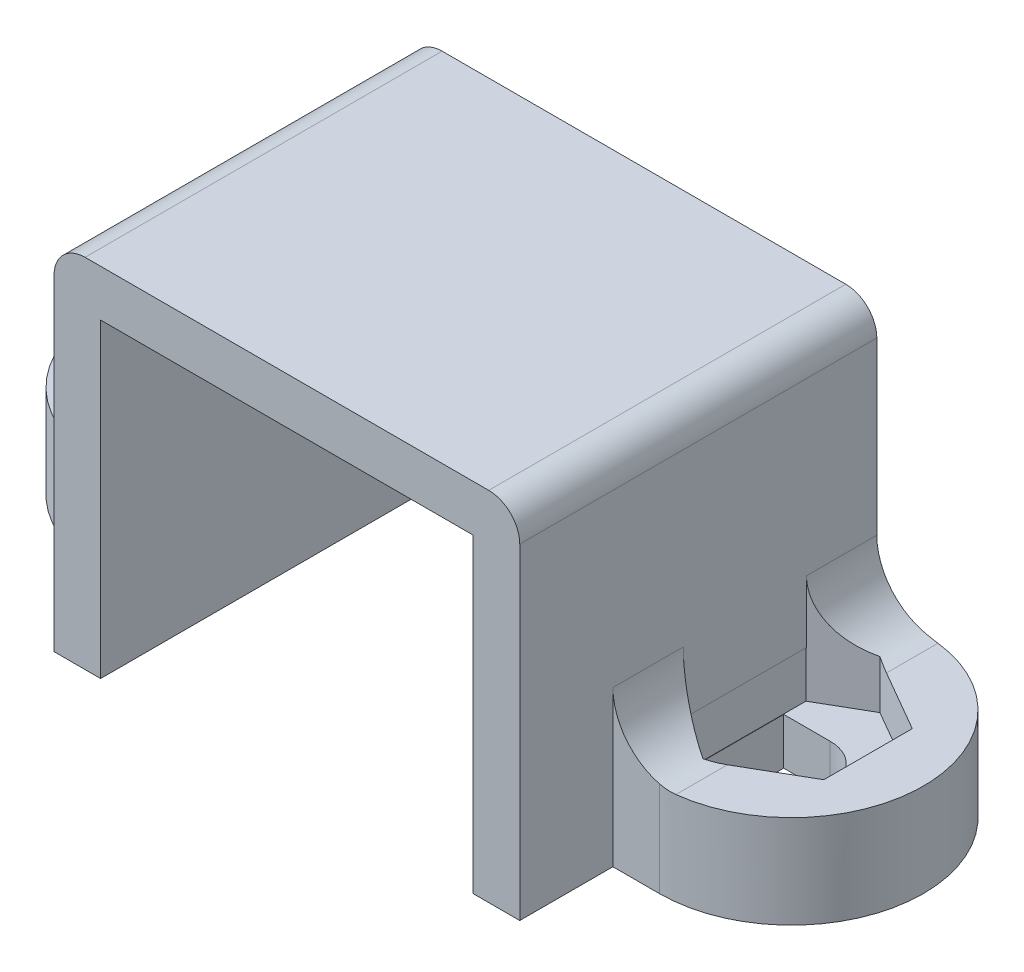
ISO-10303-21;
HEADER;
FILE_DESCRIPTION(('STEP AP214'),'2;1');
FILE_NAME('part.step','',(''),(''),'','','');
FILE_SCHEMA(('AUTOMOTIVE_DESIGN { 1 0 10303 214 1 1 1 1 }'));
ENDSEC;
DATA;
#1=APPLICATION_CONTEXT('core data for automotive mechanical design processes');
#2=APPLICATION_PROTOCOL_DEFINITION('international standard','automotive_design',2000,#1);
#3=PRODUCT_CONTEXT('',#1,'mechanical');
#4=PRODUCT('Part','Part','',(#3));
#5=PRODUCT_RELATED_PRODUCT_CATEGORY('part','',(#4));
#6=PRODUCT_DEFINITION_FORMATION('','',#4);
#7=PRODUCT_DEFINITION_CONTEXT('part definition',#1,'design');
#8=PRODUCT_DEFINITION('design','',#6,#7);
#9=PRODUCT_DEFINITION_SHAPE('','',#8);
#10=(LENGTH_UNIT() NAMED_UNIT(*) SI_UNIT(.MILLI.,.METRE.));
#11=(NAMED_UNIT(*) PLANE_ANGLE_UNIT() SI_UNIT($,.RADIAN.));
#12=(NAMED_UNIT(*) SI_UNIT($,.STERADIAN.) SOLID_ANGLE_UNIT());
#13=UNCERTAINTY_MEASURE_WITH_UNIT(LENGTH_MEASURE(1.E-05),#10,'distance_accuracy_value','');
#14=(GEOMETRIC_REPRESENTATION_CONTEXT(3) GLOBAL_UNCERTAINTY_ASSIGNED_CONTEXT((#13)) GLOBAL_UNIT_ASSIGNED_CONTEXT((#10,
#11,#12)) REPRESENTATION_CONTEXT('',''));
#15=CARTESIAN_POINT('',(0.,0.,0.));
#16=DIRECTION('',(0.,0.,1.));
#17=DIRECTION('',(1.,0.,0.));
#18=AXIS2_PLACEMENT_3D('',#15,#16,#17);
#19=CARTESIAN_POINT('',(-7.5,11.5,11.5));
#20=DIRECTION('',(1.,0.,0.));
#21=DIRECTION('',(0.,1.,0.));
#22=AXIS2_PLACEMENT_3D('',#19,#20,#21);
#23=PLANE('',#22);
#24=DIRECTION('',(0.,-1.,0.));
#25=VECTOR('',#24,1.);
#26=CARTESIAN_POINT('',(-7.5,11.5,11.5));
#27=LINE('',#26,#25);
#28=CARTESIAN_POINT('',(-7.5,10.5,11.5));
#29=VERTEX_POINT('',#28);
#30=CARTESIAN_POINT('',(-7.50000000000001,0.,11.5));
#31=VERTEX_POINT('',#30);
#32=EDGE_CURVE('E521',#29,#31,#27,.T.);
#33=ORIENTED_EDGE('',*,*,#32,.F.);
#34=DIRECTION('',(0.,0.,-1.));
#35=VECTOR('',#34,1.);
#36=CARTESIAN_POINT('',(-7.5,10.5,11.5));
#37=LINE('',#36,#35);
#38=CARTESIAN_POINT('',(-7.5,10.5,0.));
#39=VERTEX_POINT('',#38);
#40=EDGE_CURVE('E866',#29,#39,#37,.T.);
#41=ORIENTED_EDGE('',*,*,#40,.T.);
#42=DIRECTION('',(0.,-1.,0.));
#43=VECTOR('',#42,1.);
#44=CARTESIAN_POINT('',(-7.5,11.5,0.));
#45=LINE('',#44,#43);
#46=CARTESIAN_POINT('',(-7.5,5.,0.));
#47=VERTEX_POINT('',#46);
#48=EDGE_CURVE('E492',#39,#47,#45,.T.);
#49=ORIENTED_EDGE('',*,*,#48,.T.);
#50=DIRECTION('',(0.,0.,1.));
#51=VECTOR('',#50,1.);
#52=CARTESIAN_POINT('',(-7.5,5.,11.5));
#53=LINE('',#52,#51);
#54=CARTESIAN_POINT('',(-7.5,5.,2.26602540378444));
#55=VERTEX_POINT('',#54);
#56=EDGE_CURVE('E579',#47,#55,#53,.T.);
#57=ORIENTED_EDGE('',*,*,#56,.T.);
#58=DIRECTION('',(0.,-1.,0.));
#59=VECTOR('',#58,1.);
#60=CARTESIAN_POINT('',(-7.5,1.5,2.26602540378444));
#61=LINE('',#60,#59);
#62=CARTESIAN_POINT('',(-7.5,3.,2.26602540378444));
#63=VERTEX_POINT('',#62);
#64=EDGE_CURVE('E577',#55,#63,#61,.T.);
#65=ORIENTED_EDGE('',*,*,#64,.T.);
#66=DIRECTION('',(0.,0.,1.));
#67=VECTOR('',#66,1.);
#68=CARTESIAN_POINT('',(-7.50000000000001,3.,5.75000000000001));
#69=LINE('',#68,#67);
#70=CARTESIAN_POINT('',(-7.50000000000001,3.,6.23397459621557));
#71=VERTEX_POINT('',#70);
#72=EDGE_CURVE('E331',#63,#71,#69,.T.);
#73=ORIENTED_EDGE('',*,*,#72,.T.);
#74=DIRECTION('',(0.,1.,0.));
#75=VECTOR('',#74,1.);
#76=CARTESIAN_POINT('',(-7.5,1.5,6.23397459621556));
#77=LINE('',#76,#75);
#78=CARTESIAN_POINT('',(-7.5,5.,6.23397459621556));
#79=VERTEX_POINT('',#78);
#80=EDGE_CURVE('E582',#71,#79,#77,.T.);
#81=ORIENTED_EDGE('',*,*,#80,.T.);
#82=DIRECTION('',(0.,0.,1.));
#83=VECTOR('',#82,1.);
#84=CARTESIAN_POINT('',(-7.5,5.,11.5));
#85=LINE('',#84,#83);
#86=CARTESIAN_POINT('',(-7.5,5.,8.5));
#87=VERTEX_POINT('',#86);
#88=EDGE_CURVE('E585',#79,#87,#85,.T.);
#89=ORIENTED_EDGE('',*,*,#88,.T.);
#90=DIRECTION('',(0.,-1.,0.));
#91=VECTOR('',#90,1.);
#92=CARTESIAN_POINT('',(-7.50000000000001,3.,8.5));
#93=LINE('',#92,#91);
#94=CARTESIAN_POINT('',(-7.50000000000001,0.,8.5));
#95=VERTEX_POINT('',#94);
#96=EDGE_CURVE('E493',#87,#95,#93,.T.);
#97=ORIENTED_EDGE('',*,*,#96,.T.);
#98=DIRECTION('',(0.,0.,-1.));
#99=VECTOR('',#98,1.);
#100=CARTESIAN_POINT('',(-7.50000000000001,0.,11.5));
#101=LINE('',#100,#99);
#102=EDGE_CURVE('E553',#31,#95,#101,.T.);
#103=ORIENTED_EDGE('',*,*,#102,.F.);
#104=EDGE_LOOP('',(#33,#41,#49,#57,#65,#73,#81,#89,#97,#103));
#105=FACE_BOUND('',#104,.T.);
#106=ADVANCED_FACE('F27',(#105),#23,.F.);
#107=CARTESIAN_POINT('',(7.5,11.5,11.5));
#108=DIRECTION('',(-1.,0.,0.));
#109=DIRECTION('',(0.,-1.,0.));
#110=AXIS2_PLACEMENT_3D('',#107,#108,#109);
#111=PLANE('',#110);
#112=DIRECTION('',(0.,0.,-1.));
#113=VECTOR('',#112,1.);
#114=CARTESIAN_POINT('',(7.5,1.5,11.5));
#115=LINE('',#114,#113);
#116=CARTESIAN_POINT('',(7.50000000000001,1.5,5.5));
#117=VERTEX_POINT('',#116);
#118=CARTESIAN_POINT('',(7.50000000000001,1.5,3.));
#119=VERTEX_POINT('',#118);
#120=EDGE_CURVE('E431',#117,#119,#115,.T.);
#121=ORIENTED_EDGE('',*,*,#120,.F.);
#122=DIRECTION('',(0.,-1.,0.));
#123=VECTOR('',#122,1.);
#124=CARTESIAN_POINT('',(7.50000000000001,3.,5.5));
#125=LINE('',#124,#123);
#126=CARTESIAN_POINT('',(7.50000000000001,0.,5.5));
#127=VERTEX_POINT('',#126);
#128=EDGE_CURVE('E462',#117,#127,#125,.T.);
#129=ORIENTED_EDGE('',*,*,#128,.T.);
#130=DIRECTION('',(0.,0.,-1.));
#131=VECTOR('',#130,1.);
#132=CARTESIAN_POINT('',(7.50000000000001,0.,11.5));
#133=LINE('',#132,#131);
#134=CARTESIAN_POINT('',(7.50000000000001,0.,3.));
#135=VERTEX_POINT('',#134);
#136=EDGE_CURVE('E537',#127,#135,#133,.T.);
#137=ORIENTED_EDGE('',*,*,#136,.T.);
#138=DIRECTION('',(0.,-1.,0.));
#139=VECTOR('',#138,1.);
#140=CARTESIAN_POINT('',(7.50000000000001,3.,3.));
#141=LINE('',#140,#139);
#142=EDGE_CURVE('E455',#119,#135,#141,.T.);
#143=ORIENTED_EDGE('',*,*,#142,.F.);
#144=EDGE_LOOP('',(#121,#129,#137,#143));
#145=FACE_BOUND('',#144,.T.);
#146=ADVANCED_FACE('F696',(#145),#111,.F.);
#147=CARTESIAN_POINT('',(-22.6107893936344,3.,3.));
#148=DIRECTION('',(0.,0.,-1.));
#149=DIRECTION('',(-1.,0.,0.));
#150=AXIS2_PLACEMENT_3D('',#147,#148,#149);
#151=PLANE('',#150);
#152=DIRECTION('',(1.,0.,0.));
#153=VECTOR('',#152,1.);
#154=CARTESIAN_POINT('',(-22.6107893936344,1.5,3.));
#155=LINE('',#154,#153);
#156=CARTESIAN_POINT('',(8.99999999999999,1.5,3.));
#157=VERTEX_POINT('',#156);
#158=EDGE_CURVE('E429',#119,#157,#155,.T.);
#159=ORIENTED_EDGE('',*,*,#158,.F.);
#160=ORIENTED_EDGE('',*,*,#142,.T.);
#161=DIRECTION('',(1.,0.,0.));
#162=VECTOR('',#161,1.);
#163=CARTESIAN_POINT('',(-22.6107893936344,0.,3.));
#164=LINE('',#163,#162);
#165=CARTESIAN_POINT('',(8.99999999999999,0.,3.));
#166=VERTEX_POINT('',#165);
#167=EDGE_CURVE('E445',#135,#166,#164,.T.);
#168=ORIENTED_EDGE('',*,*,#167,.T.);
#169=DIRECTION('',(0.,-1.,0.));
#170=VECTOR('',#169,1.);
#171=CARTESIAN_POINT('',(8.99999999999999,3.,3.));
#172=LINE('',#171,#170);
#173=EDGE_CURVE('E458',#157,#166,#172,.T.);
#174=ORIENTED_EDGE('',*,*,#173,.F.);
#175=EDGE_LOOP('',(#159,#160,#168,#174));
#176=FACE_BOUND('',#175,.T.);
#177=ADVANCED_FACE('F702',(#176),#151,.F.);
#178=CARTESIAN_POINT('',(9.,3.,4.25));
#179=DIRECTION('',(0.,-1.,0.));
#180=DIRECTION('',(1.,0.,0.));
#181=AXIS2_PLACEMENT_3D('',#178,#179,#180);
#182=CYLINDRICAL_SURFACE('',#181,1.25);
#183=CARTESIAN_POINT('',(9.,1.5,4.25));
#184=DIRECTION('',(0.,1.,0.));
#185=DIRECTION('',(0.,0.,1.));
#186=AXIS2_PLACEMENT_3D('',#183,#184,#185);
#187=CIRCLE('',#186,1.25);
#188=CARTESIAN_POINT('',(8.99999999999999,1.5,5.5));
#189=VERTEX_POINT('',#188);
#190=EDGE_CURVE('E416',#157,#189,#187,.F.);
#191=ORIENTED_EDGE('',*,*,#190,.F.);
#192=ORIENTED_EDGE('',*,*,#173,.T.);
#193=CARTESIAN_POINT('',(9.,0.,4.25));
#194=DIRECTION('',(0.,1.,0.));
#195=DIRECTION('',(-1.,0.,0.));
#196=AXIS2_PLACEMENT_3D('',#193,#194,#195);
#197=CIRCLE('',#196,1.25);
#198=CARTESIAN_POINT('',(8.99999999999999,0.,5.5));
#199=VERTEX_POINT('',#198);
#200=EDGE_CURVE('E442',#166,#199,#197,.F.);
#201=ORIENTED_EDGE('',*,*,#200,.T.);
#202=DIRECTION('',(0.,-1.,0.));
#203=VECTOR('',#202,1.);
#204=CARTESIAN_POINT('',(8.99999999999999,3.,5.5));
#205=LINE('',#204,#203);
#206=EDGE_CURVE('E460',#189,#199,#205,.T.);
#207=ORIENTED_EDGE('',*,*,#206,.F.);
#208=EDGE_LOOP('',(#191,#192,#201,#207));
#209=FACE_BOUND('',#208,.T.);
#210=ADVANCED_FACE('F795',(#209),#182,.F.);
#211=CARTESIAN_POINT('',(-22.6107893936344,3.,5.5));
#212=DIRECTION('',(0.,0.,-1.));
#213=DIRECTION('',(-1.,0.,0.));
#214=AXIS2_PLACEMENT_3D('',#211,#212,#213);
#215=PLANE('',#214);
#216=ORIENTED_EDGE('',*,*,#128,.F.);
#217=DIRECTION('',(1.,0.,0.));
#218=VECTOR('',#217,1.);
#219=CARTESIAN_POINT('',(-22.6107893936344,1.5,5.5));
#220=LINE('',#219,#218);
#221=EDGE_CURVE('E556',#117,#189,#220,.T.);
#222=ORIENTED_EDGE('',*,*,#221,.T.);
#223=ORIENTED_EDGE('',*,*,#206,.T.);
#224=DIRECTION('',(1.,0.,0.));
#225=VECTOR('',#224,1.);
#226=CARTESIAN_POINT('',(-22.6107893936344,0.,5.5));
#227=LINE('',#226,#225);
#228=EDGE_CURVE('E439',#127,#199,#227,.T.);
#229=ORIENTED_EDGE('',*,*,#228,.F.);
#230=EDGE_LOOP('',(#216,#222,#223,#229));
#231=FACE_BOUND('',#230,.T.);
#232=ADVANCED_FACE('F716',(#231),#215,.T.);
#233=DIRECTION('',(0.,1.,0.));
#234=VECTOR('',#233,1.);
#235=CARTESIAN_POINT('',(7.5,11.5,0.));
#236=LINE('',#235,#234);
#237=CARTESIAN_POINT('',(7.5,5.,0.));
#238=VERTEX_POINT('',#237);
#239=CARTESIAN_POINT('',(7.5,10.5,0.));
#240=VERTEX_POINT('',#239);
#241=EDGE_CURVE('E517',#238,#240,#236,.T.);
#242=ORIENTED_EDGE('',*,*,#241,.T.);
#243=DIRECTION('',(0.,0.,-1.));
#244=VECTOR('',#243,1.);
#245=CARTESIAN_POINT('',(7.5,10.5,11.5));
#246=LINE('',#245,#244);
#247=CARTESIAN_POINT('',(7.5,10.5,11.5));
#248=VERTEX_POINT('',#247);
#249=EDGE_CURVE('E11',#240,#248,#246,.F.);
#250=ORIENTED_EDGE('',*,*,#249,.T.);
#251=DIRECTION('',(0.,1.,0.));
#252=VECTOR('',#251,1.);
#253=CARTESIAN_POINT('',(7.5,11.5,11.5));
#254=LINE('',#253,#252);
#255=CARTESIAN_POINT('',(7.50000000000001,0.,11.5));
#256=VERTEX_POINT('',#255);
#257=EDGE_CURVE('E533',#256,#248,#254,.T.);
#258=ORIENTED_EDGE('',*,*,#257,.F.);
#259=CARTESIAN_POINT('',(7.50000000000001,0.,8.5));
#260=VERTEX_POINT('',#259);
#261=EDGE_CURVE('E538',#256,#260,#133,.T.);
#262=ORIENTED_EDGE('',*,*,#261,.T.);
#263=DIRECTION('',(0.,-1.,0.));
#264=VECTOR('',#263,1.);
#265=CARTESIAN_POINT('',(7.50000000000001,3.,8.5));
#266=LINE('',#265,#264);
#267=CARTESIAN_POINT('',(7.5,5.,8.5));
#268=VERTEX_POINT('',#267);
#269=EDGE_CURVE('E464',#268,#260,#266,.T.);
#270=ORIENTED_EDGE('',*,*,#269,.F.);
#271=DIRECTION('',(0.,0.,1.));
#272=VECTOR('',#271,1.);
#273=CARTESIAN_POINT('',(7.5,5.,11.5));
#274=LINE('',#273,#272);
#275=CARTESIAN_POINT('',(7.5,5.,6.23397459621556));
#276=VERTEX_POINT('',#275);
#277=EDGE_CURVE('E569',#268,#276,#274,.F.);
#278=ORIENTED_EDGE('',*,*,#277,.T.);
#279=DIRECTION('',(0.,-1.,0.));
#280=VECTOR('',#279,1.);
#281=CARTESIAN_POINT('',(7.5,1.5,6.23397459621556));
#282=LINE('',#281,#280);
#283=CARTESIAN_POINT('',(7.5,3.,6.23397459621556));
#284=VERTEX_POINT('',#283);
#285=EDGE_CURVE('E567',#276,#284,#282,.T.);
#286=ORIENTED_EDGE('',*,*,#285,.T.);
#287=DIRECTION('',(0.,0.,1.));
#288=VECTOR('',#287,1.);
#289=CARTESIAN_POINT('',(7.50000000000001,3.,5.75000000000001));
#290=LINE('',#289,#288);
#291=CARTESIAN_POINT('',(7.50000000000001,3.,2.26602540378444));
#292=VERTEX_POINT('',#291);
#293=EDGE_CURVE('E451',#292,#284,#290,.T.);
#294=ORIENTED_EDGE('',*,*,#293,.F.);
#295=DIRECTION('',(0.,1.,0.));
#296=VECTOR('',#295,1.);
#297=CARTESIAN_POINT('',(7.5,1.5,2.26602540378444));
#298=LINE('',#297,#296);
#299=CARTESIAN_POINT('',(7.5,5.,2.26602540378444));
#300=VERTEX_POINT('',#299);
#301=EDGE_CURVE('E574',#292,#300,#298,.T.);
#302=ORIENTED_EDGE('',*,*,#301,.T.);
#303=DIRECTION('',(0.,0.,1.));
#304=VECTOR('',#303,1.);
#305=CARTESIAN_POINT('',(7.5,5.,11.5));
#306=LINE('',#305,#304);
#307=EDGE_CURVE('E572',#300,#238,#306,.F.);
#308=ORIENTED_EDGE('',*,*,#307,.T.);
#309=EDGE_LOOP('',(#242,#250,#258,#262,#270,#278,#286,#294,#302,#308));
#310=FACE_BOUND('',#309,.T.);
#311=ADVANCED_FACE('F705',(#310),#111,.F.);
#312=DIRECTION('',(0.,-1.,0.));
#313=VECTOR('',#312,1.);
#314=CARTESIAN_POINT('',(-7.50000000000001,3.,5.5));
#315=LINE('',#314,#313);
#316=CARTESIAN_POINT('',(-7.50000000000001,1.5,5.5));
#317=VERTEX_POINT('',#316);
#318=CARTESIAN_POINT('',(-7.50000000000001,0.,5.5));
#319=VERTEX_POINT('',#318);
#320=EDGE_CURVE('E496',#317,#319,#315,.T.);
#321=ORIENTED_EDGE('',*,*,#320,.F.);
#322=DIRECTION('',(0.,0.,-1.));
#323=VECTOR('',#322,1.);
#324=CARTESIAN_POINT('',(-7.5,1.5,11.5));
#325=LINE('',#324,#323);
#326=CARTESIAN_POINT('',(-7.50000000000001,1.5,3.));
#327=VERTEX_POINT('',#326);
#328=EDGE_CURVE('E376',#317,#327,#325,.T.);
#329=ORIENTED_EDGE('',*,*,#328,.T.);
#330=DIRECTION('',(0.,-1.,0.));
#331=VECTOR('',#330,1.);
#332=CARTESIAN_POINT('',(-7.50000000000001,3.,3.));
#333=LINE('',#332,#331);
#334=CARTESIAN_POINT('',(-7.50000000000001,0.,3.));
#335=VERTEX_POINT('',#334);
#336=EDGE_CURVE('E502',#327,#335,#333,.T.);
#337=ORIENTED_EDGE('',*,*,#336,.T.);
#338=EDGE_CURVE('E552',#319,#335,#101,.T.);
#339=ORIENTED_EDGE('',*,*,#338,.F.);
#340=EDGE_LOOP('',(#321,#329,#337,#339));
#341=FACE_BOUND('',#340,.T.);
#342=ADVANCED_FACE('F29',(#341),#23,.F.);
#343=CARTESIAN_POINT('',(-7.50000000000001,0.,11.5));
#344=DIRECTION('',(0.,1.,0.));
#345=DIRECTION('',(-1.,0.,0.));
#346=AXIS2_PLACEMENT_3D('',#343,#344,#345);
#347=PLANE('',#346);
#348=ORIENTED_EDGE('',*,*,#102,.T.);
#349=DIRECTION('',(-1.,0.,0.));
#350=VECTOR('',#349,1.);
#351=CARTESIAN_POINT('',(-22.6107893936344,0.,8.5));
#352=LINE('',#351,#350);
#353=CARTESIAN_POINT('',(-9.,0.,8.5));
#354=VERTEX_POINT('',#353);
#355=EDGE_CURVE('E482',#95,#354,#352,.T.);
#356=ORIENTED_EDGE('',*,*,#355,.T.);
#357=CARTESIAN_POINT('',(-9.,0.,4.25));
#358=DIRECTION('',(0.,1.,0.));
#359=DIRECTION('',(-1.,0.,0.));
#360=AXIS2_PLACEMENT_3D('',#357,#358,#359);
#361=CIRCLE('',#360,4.25);
#362=CARTESIAN_POINT('',(-9.,0.,0.));
#363=VERTEX_POINT('',#362);
#364=EDGE_CURVE('E457',#363,#354,#361,.T.);
#365=ORIENTED_EDGE('',*,*,#364,.F.);
#366=DIRECTION('',(1.,0.,0.));
#367=VECTOR('',#366,1.);
#368=CARTESIAN_POINT('',(-7.50000000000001,0.,0.));
#369=LINE('',#368,#367);
#370=CARTESIAN_POINT('',(-6.,0.,0.));
#371=VERTEX_POINT('',#370);
#372=EDGE_CURVE('E507',#363,#371,#369,.T.);
#373=ORIENTED_EDGE('',*,*,#372,.T.);
#374=DIRECTION('',(0.,0.,-1.));
#375=VECTOR('',#374,1.);
#376=CARTESIAN_POINT('',(-6.,0.,11.5));
#377=LINE('',#376,#375);
#378=CARTESIAN_POINT('',(-6.,0.,11.5));
#379=VERTEX_POINT('',#378);
#380=EDGE_CURVE('E549',#379,#371,#377,.T.);
#381=ORIENTED_EDGE('',*,*,#380,.F.);
#382=DIRECTION('',(1.,0.,0.));
#383=VECTOR('',#382,1.);
#384=CARTESIAN_POINT('',(-7.50000000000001,0.,11.5));
#385=LINE('',#384,#383);
#386=EDGE_CURVE('E523',#31,#379,#385,.T.);
#387=ORIENTED_EDGE('',*,*,#386,.F.);
#388=EDGE_LOOP('',(#348,#356,#365,#373,#381,#387));
#389=FACE_BOUND('',#388,.T.);
#390=DIRECTION('',(-1.,0.,0.));
#391=VECTOR('',#390,1.);
#392=CARTESIAN_POINT('',(-22.6107893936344,0.,5.5));
#393=LINE('',#392,#391);
#394=CARTESIAN_POINT('',(-9.,0.,5.5));
#395=VERTEX_POINT('',#394);
#396=EDGE_CURVE('E479',#319,#395,#393,.T.);
#397=ORIENTED_EDGE('',*,*,#396,.F.);
#398=ORIENTED_EDGE('',*,*,#338,.T.);
#399=DIRECTION('',(-1.,0.,0.));
#400=VECTOR('',#399,1.);
#401=CARTESIAN_POINT('',(-22.6107893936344,0.,3.));
#402=LINE('',#401,#400);
#403=CARTESIAN_POINT('',(-9.,0.,3.));
#404=VERTEX_POINT('',#403);
#405=EDGE_CURVE('E473',#335,#404,#402,.T.);
#406=ORIENTED_EDGE('',*,*,#405,.T.);
#407=CARTESIAN_POINT('',(-9.,0.,4.25));
#408=DIRECTION('',(0.,1.,0.));
#409=DIRECTION('',(-1.,0.,0.));
#410=AXIS2_PLACEMENT_3D('',#407,#408,#409);
#411=CIRCLE('',#410,1.25);
#412=EDGE_CURVE('E476',#404,#395,#411,.T.);
#413=ORIENTED_EDGE('',*,*,#412,.T.);
#414=EDGE_LOOP('',(#397,#398,#406,#413));
#415=FACE_BOUND('',#414,.T.);
#416=ADVANCED_FACE('F708',(#389,#415),#347,.F.);
#417=CARTESIAN_POINT('',(-6.,10.,11.5));
#418=DIRECTION('',(-1.,0.,0.));
#419=DIRECTION('',(0.,0.,1.));
#420=AXIS2_PLACEMENT_3D('',#417,#418,#419);
#421=PLANE('',#420);
#422=DIRECTION('',(0.,1.,0.));
#423=VECTOR('',#422,1.);
#424=CARTESIAN_POINT('',(-6.,10.,0.));
#425=LINE('',#424,#423);
#426=CARTESIAN_POINT('',(-6.,10.,0.));
#427=VERTEX_POINT('',#426);
#428=EDGE_CURVE('E509',#371,#427,#425,.T.);
#429=ORIENTED_EDGE('',*,*,#428,.T.);
#430=DIRECTION('',(0.,0.,-1.));
#431=VECTOR('',#430,1.);
#432=CARTESIAN_POINT('',(-6.,10.,11.5));
#433=LINE('',#432,#431);
#434=CARTESIAN_POINT('',(-6.,10.,11.5));
#435=VERTEX_POINT('',#434);
#436=EDGE_CURVE('E546',#435,#427,#433,.T.);
#437=ORIENTED_EDGE('',*,*,#436,.F.);
#438=DIRECTION('',(0.,1.,0.));
#439=VECTOR('',#438,1.);
#440=CARTESIAN_POINT('',(-6.,10.,11.5));
#441=LINE('',#440,#439);
#442=EDGE_CURVE('E525',#379,#435,#441,.T.);
#443=ORIENTED_EDGE('',*,*,#442,.F.);
#444=ORIENTED_EDGE('',*,*,#380,.T.);
#445=EDGE_LOOP('',(#429,#437,#443,#444));
#446=FACE_BOUND('',#445,.T.);
#447=ADVANCED_FACE('F714',(#446),#421,.F.);
#448=CARTESIAN_POINT('',(6.,10.,11.5));
#449=DIRECTION('',(0.,1.,0.));
#450=DIRECTION('',(0.,0.,1.));
#451=AXIS2_PLACEMENT_3D('',#448,#449,#450);
#452=PLANE('',#451);
#453=DIRECTION('',(1.,0.,0.));
#454=VECTOR('',#453,1.);
#455=CARTESIAN_POINT('',(6.,10.,0.));
#456=LINE('',#455,#454);
#457=CARTESIAN_POINT('',(6.,10.,0.));
#458=VERTEX_POINT('',#457);
#459=EDGE_CURVE('E511',#427,#458,#456,.T.);
#460=ORIENTED_EDGE('',*,*,#459,.T.);
#461=DIRECTION('',(0.,0.,-1.));
#462=VECTOR('',#461,1.);
#463=CARTESIAN_POINT('',(6.,10.,11.5));
#464=LINE('',#463,#462);
#465=CARTESIAN_POINT('',(6.,10.,11.5));
#466=VERTEX_POINT('',#465);
#467=EDGE_CURVE('E543',#466,#458,#464,.T.);
#468=ORIENTED_EDGE('',*,*,#467,.F.);
#469=DIRECTION('',(1.,0.,0.));
#470=VECTOR('',#469,1.);
#471=CARTESIAN_POINT('',(6.,10.,11.5));
#472=LINE('',#471,#470);
#473=EDGE_CURVE('E527',#435,#466,#472,.T.);
#474=ORIENTED_EDGE('',*,*,#473,.F.);
#475=ORIENTED_EDGE('',*,*,#436,.T.);
#476=EDGE_LOOP('',(#460,#468,#474,#475));
#477=FACE_BOUND('',#476,.T.);
#478=ADVANCED_FACE('F828',(#477),#452,.F.);
#479=CARTESIAN_POINT('',(6.,10.,11.5));
#480=DIRECTION('',(1.,0.,0.));
#481=DIRECTION('',(0.,0.,-1.));
#482=AXIS2_PLACEMENT_3D('',#479,#480,#481);
#483=PLANE('',#482);
#484=DIRECTION('',(0.,-1.,0.));
#485=VECTOR('',#484,1.);
#486=CARTESIAN_POINT('',(6.,10.,0.));
#487=LINE('',#486,#485);
#488=CARTESIAN_POINT('',(6.,0.,0.));
#489=VERTEX_POINT('',#488);
#490=EDGE_CURVE('E513',#458,#489,#487,.T.);
#491=ORIENTED_EDGE('',*,*,#490,.T.);
#492=DIRECTION('',(0.,0.,-1.));
#493=VECTOR('',#492,1.);
#494=CARTESIAN_POINT('',(6.,0.,11.5));
#495=LINE('',#494,#493);
#496=CARTESIAN_POINT('',(6.,0.,11.5));
#497=VERTEX_POINT('',#496);
#498=EDGE_CURVE('E540',#497,#489,#495,.T.);
#499=ORIENTED_EDGE('',*,*,#498,.F.);
#500=DIRECTION('',(0.,-1.,0.));
#501=VECTOR('',#500,1.);
#502=CARTESIAN_POINT('',(6.,10.,11.5));
#503=LINE('',#502,#501);
#504=EDGE_CURVE('E529',#466,#497,#503,.T.);
#505=ORIENTED_EDGE('',*,*,#504,.F.);
#506=ORIENTED_EDGE('',*,*,#467,.T.);
#507=EDGE_LOOP('',(#491,#499,#505,#506));
#508=FACE_BOUND('',#507,.T.);
#509=ADVANCED_FACE('F819',(#508),#483,.F.);
#510=CARTESIAN_POINT('',(6.,0.,11.5));
#511=DIRECTION('',(0.,1.,0.));
#512=DIRECTION('',(-1.,0.,0.));
#513=AXIS2_PLACEMENT_3D('',#510,#511,#512);
#514=PLANE('',#513);
#515=DIRECTION('',(1.,0.,0.));
#516=VECTOR('',#515,1.);
#517=CARTESIAN_POINT('',(-22.6107893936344,0.,8.5));
#518=LINE('',#517,#516);
#519=CARTESIAN_POINT('',(8.99999999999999,0.,8.5));
#520=VERTEX_POINT('',#519);
#521=EDGE_CURVE('E436',#260,#520,#518,.T.);
#522=ORIENTED_EDGE('',*,*,#521,.F.);
#523=ORIENTED_EDGE('',*,*,#261,.F.);
#524=DIRECTION('',(1.,0.,0.));
#525=VECTOR('',#524,1.);
#526=CARTESIAN_POINT('',(6.,0.,11.5));
#527=LINE('',#526,#525);
#528=EDGE_CURVE('E531',#497,#256,#527,.T.);
#529=ORIENTED_EDGE('',*,*,#528,.F.);
#530=ORIENTED_EDGE('',*,*,#498,.T.);
#531=DIRECTION('',(1.,0.,0.));
#532=VECTOR('',#531,1.);
#533=CARTESIAN_POINT('',(6.,0.,0.));
#534=LINE('',#533,#532);
#535=CARTESIAN_POINT('',(8.99999999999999,0.,0.));
#536=VERTEX_POINT('',#535);
#537=EDGE_CURVE('E515',#489,#536,#534,.T.);
#538=ORIENTED_EDGE('',*,*,#537,.T.);
#539=CARTESIAN_POINT('',(9.,0.,4.25));
#540=DIRECTION('',(0.,1.,0.));
#541=DIRECTION('',(-1.,0.,0.));
#542=AXIS2_PLACEMENT_3D('',#539,#540,#541);
#543=CIRCLE('',#542,4.25);
#544=EDGE_CURVE('E433',#536,#520,#543,.F.);
#545=ORIENTED_EDGE('',*,*,#544,.T.);
#546=EDGE_LOOP('',(#522,#523,#529,#530,#538,#545));
#547=FACE_BOUND('',#546,.T.);
#548=ORIENTED_EDGE('',*,*,#136,.F.);
#549=ORIENTED_EDGE('',*,*,#228,.T.);
#550=ORIENTED_EDGE('',*,*,#200,.F.);
#551=ORIENTED_EDGE('',*,*,#167,.F.);
#552=EDGE_LOOP('',(#548,#549,#550,#551));
#553=FACE_BOUND('',#552,.T.);
#554=ADVANCED_FACE('F811',(#547,#553),#514,.F.);
#555=CARTESIAN_POINT('',(7.5,11.5,11.5));
#556=DIRECTION('',(0.,-1.,0.));
#557=DIRECTION('',(0.,0.,-1.));
#558=AXIS2_PLACEMENT_3D('',#555,#556,#557);
#559=PLANE('',#558);
#560=DIRECTION('',(-1.,0.,0.));
#561=VECTOR('',#560,1.);
#562=CARTESIAN_POINT('',(7.5,11.5,0.));
#563=LINE('',#562,#561);
#564=CARTESIAN_POINT('',(6.5,11.5,0.));
#565=VERTEX_POINT('',#564);
#566=CARTESIAN_POINT('',(-6.5,11.5,0.));
#567=VERTEX_POINT('',#566);
#568=EDGE_CURVE('E519',#565,#567,#563,.T.);
#569=ORIENTED_EDGE('',*,*,#568,.T.);
#570=DIRECTION('',(0.,0.,-1.));
#571=VECTOR('',#570,1.);
#572=CARTESIAN_POINT('',(-6.5,11.5,11.5));
#573=LINE('',#572,#571);
#574=CARTESIAN_POINT('',(-6.5,11.5,11.5));
#575=VERTEX_POINT('',#574);
#576=EDGE_CURVE('E48',#567,#575,#573,.F.);
#577=ORIENTED_EDGE('',*,*,#576,.T.);
#578=DIRECTION('',(-1.,0.,0.));
#579=VECTOR('',#578,1.);
#580=CARTESIAN_POINT('',(7.5,11.5,11.5));
#581=LINE('',#580,#579);
#582=CARTESIAN_POINT('',(6.5,11.5,11.5));
#583=VERTEX_POINT('',#582);
#584=EDGE_CURVE('E535',#583,#575,#581,.T.);
#585=ORIENTED_EDGE('',*,*,#584,.F.);
#586=DIRECTION('',(0.,0.,-1.));
#587=VECTOR('',#586,1.);
#588=CARTESIAN_POINT('',(6.5,11.5,11.5));
#589=LINE('',#588,#587);
#590=EDGE_CURVE('E874',#583,#565,#589,.T.);
#591=ORIENTED_EDGE('',*,*,#590,.T.);
#592=EDGE_LOOP('',(#569,#577,#585,#591));
#593=FACE_BOUND('',#592,.T.);
#594=ADVANCED_FACE('F818',(#593),#559,.F.);
#595=CARTESIAN_POINT('',(-7.50000000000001,0.,11.5));
#596=DIRECTION('',(0.,0.,1.));
#597=DIRECTION('',(1.,0.,0.));
#598=AXIS2_PLACEMENT_3D('',#595,#596,#597);
#599=PLANE('',#598);
#600=ORIENTED_EDGE('',*,*,#584,.T.);
#601=CARTESIAN_POINT('',(-6.5,10.5,11.5));
#602=DIRECTION('',(0.,0.,1.));
#603=DIRECTION('',(1.,0.,0.));
#604=AXIS2_PLACEMENT_3D('',#601,#602,#603);
#605=CIRCLE('',#604,1.);
#606=EDGE_CURVE('E35',#575,#29,#605,.T.);
#607=ORIENTED_EDGE('',*,*,#606,.T.);
#608=ORIENTED_EDGE('',*,*,#32,.T.);
#609=ORIENTED_EDGE('',*,*,#386,.T.);
#610=ORIENTED_EDGE('',*,*,#442,.T.);
#611=ORIENTED_EDGE('',*,*,#473,.T.);
#612=ORIENTED_EDGE('',*,*,#504,.T.);
#613=ORIENTED_EDGE('',*,*,#528,.T.);
#614=ORIENTED_EDGE('',*,*,#257,.T.);
#615=CARTESIAN_POINT('',(6.5,10.5,11.5));
#616=DIRECTION('',(0.,0.,1.));
#617=DIRECTION('',(1.,0.,0.));
#618=AXIS2_PLACEMENT_3D('',#615,#616,#617);
#619=CIRCLE('',#618,1.);
#620=EDGE_CURVE('E878',#248,#583,#619,.T.);
#621=ORIENTED_EDGE('',*,*,#620,.T.);
#622=EDGE_LOOP('',(#600,#607,#608,#609,#610,#611,#612,#613,#614,#621));
#623=FACE_BOUND('',#622,.T.);
#624=ADVANCED_FACE('F825',(#623),#599,.T.);
#625=CARTESIAN_POINT('',(-7.50000000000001,0.,0.));
#626=DIRECTION('',(0.,0.,1.));
#627=DIRECTION('',(1.,0.,0.));
#628=AXIS2_PLACEMENT_3D('',#625,#626,#627);
#629=PLANE('',#628);
#630=ORIENTED_EDGE('',*,*,#48,.F.);
#631=CARTESIAN_POINT('',(-6.5,10.5,0.));
#632=DIRECTION('',(0.,0.,1.));
#633=DIRECTION('',(1.,0.,0.));
#634=AXIS2_PLACEMENT_3D('',#631,#632,#633);
#635=CIRCLE('',#634,1.);
#636=EDGE_CURVE('E870',#39,#567,#635,.F.);
#637=ORIENTED_EDGE('',*,*,#636,.T.);
#638=ORIENTED_EDGE('',*,*,#568,.F.);
#639=CARTESIAN_POINT('',(6.5,10.5,0.));
#640=DIRECTION('',(0.,0.,1.));
#641=DIRECTION('',(1.,0.,0.));
#642=AXIS2_PLACEMENT_3D('',#639,#640,#641);
#643=CIRCLE('',#642,1.);
#644=EDGE_CURVE('E868',#565,#240,#643,.F.);
#645=ORIENTED_EDGE('',*,*,#644,.T.);
#646=ORIENTED_EDGE('',*,*,#241,.F.);
#647=CARTESIAN_POINT('',(9.5,5.,0.));
#648=DIRECTION('',(0.,0.,1.));
#649=DIRECTION('',(1.,0.,0.));
#650=AXIS2_PLACEMENT_3D('',#647,#648,#649);
#651=CIRCLE('',#650,2.);
#652=CARTESIAN_POINT('',(8.99999999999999,3.06350832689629,0.));
#653=VERTEX_POINT('',#652);
#654=EDGE_CURVE('E597',#238,#653,#651,.T.);
#655=ORIENTED_EDGE('',*,*,#654,.T.);
#656=DIRECTION('',(0.,-1.,0.));
#657=VECTOR('',#656,1.);
#658=CARTESIAN_POINT('',(8.99999999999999,3.,0.));
#659=LINE('',#658,#657);
#660=EDGE_CURVE('E454',#653,#536,#659,.T.);
#661=ORIENTED_EDGE('',*,*,#660,.T.);
#662=ORIENTED_EDGE('',*,*,#537,.F.);
#663=ORIENTED_EDGE('',*,*,#490,.F.);
#664=ORIENTED_EDGE('',*,*,#459,.F.);
#665=ORIENTED_EDGE('',*,*,#428,.F.);
#666=ORIENTED_EDGE('',*,*,#372,.F.);
#667=DIRECTION('',(0.,-1.,0.));
#668=VECTOR('',#667,1.);
#669=CARTESIAN_POINT('',(-9.,3.,0.));
#670=LINE('',#669,#668);
#671=CARTESIAN_POINT('',(-9.,3.06350832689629,0.));
#672=VERTEX_POINT('',#671);
#673=EDGE_CURVE('E489',#672,#363,#670,.T.);
#674=ORIENTED_EDGE('',*,*,#673,.F.);
#675=CARTESIAN_POINT('',(-9.5,5.,0.));
#676=DIRECTION('',(0.,0.,1.));
#677=DIRECTION('',(1.,0.,0.));
#678=AXIS2_PLACEMENT_3D('',#675,#676,#677);
#679=CIRCLE('',#678,2.);
#680=EDGE_CURVE('E671',#672,#47,#679,.T.);
#681=ORIENTED_EDGE('',*,*,#680,.T.);
#682=EDGE_LOOP('',(#630,#637,#638,#645,#646,#655,#661,#662,#663,#664,#665,#666,#674,#681));
#683=FACE_BOUND('',#682,.T.);
#684=ADVANCED_FACE('F650',(#683),#629,.F.);
#685=CARTESIAN_POINT('',(-9.,3.,4.25));
#686=DIRECTION('',(0.,-1.,0.));
#687=DIRECTION('',(1.,0.,0.));
#688=AXIS2_PLACEMENT_3D('',#685,#686,#687);
#689=CYLINDRICAL_SURFACE('',#688,4.25);
#690=ORIENTED_EDGE('',*,*,#364,.T.);
#691=DIRECTION('',(0.,-1.,0.));
#692=VECTOR('',#691,1.);
#693=CARTESIAN_POINT('',(-9.,3.,8.5));
#694=LINE('',#693,#692);
#695=CARTESIAN_POINT('',(-9.,3.06350832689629,8.5));
#696=VERTEX_POINT('',#695);
#697=EDGE_CURVE('E490',#696,#354,#694,.T.);
#698=ORIENTED_EDGE('',*,*,#697,.F.);
#699=CARTESIAN_POINT('',(-9.,3.06350832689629,8.5));
#700=CARTESIAN_POINT('',(-9.04096730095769,3.05292713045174,8.50000336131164));
#701=CARTESIAN_POINT('',(-9.0822725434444,3.04365238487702,8.49940764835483));
#702=CARTESIAN_POINT('',(-9.16515193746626,3.0277816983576,8.49699048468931));
#703=CARTESIAN_POINT('',(-9.20672382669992,3.0211730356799,8.49517496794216));
#704=CARTESIAN_POINT('',(-9.29012925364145,3.01059773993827,8.49029125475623));
#705=CARTESIAN_POINT('',(-9.33196279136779,3.00663110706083,8.48722305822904));
#706=CARTESIAN_POINT('',(-9.41588929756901,3.0013241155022,8.47981404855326));
#707=CARTESIAN_POINT('',(-9.45798253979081,2.99999659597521,8.475467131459));
#708=CARTESIAN_POINT('',(-9.50000000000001,3.,8.47048575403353));
#709=B_SPLINE_CURVE_WITH_KNOTS('',3,(#699,#700,#701,#702,#703,#704,#705,#706,#707,#708),
.UNSPECIFIED.,.F.,.F.,(4,2,2,2,4),(0.,0.126910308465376,0.253207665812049,0.379505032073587,
0.50641533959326),.UNSPECIFIED.);
#710=CARTESIAN_POINT('',(-9.5,3.,8.47048575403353));
#711=VERTEX_POINT('',#710);
#712=EDGE_CURVE('E655',#696,#711,#709,.T.);
#713=ORIENTED_EDGE('',*,*,#712,.T.);
#714=CARTESIAN_POINT('',(-9.,3.,4.25));
#715=DIRECTION('',(0.,1.,0.));
#716=DIRECTION('',(-1.,0.,0.));
#717=AXIS2_PLACEMENT_3D('',#714,#715,#716);
#718=CIRCLE('',#717,4.25);
#719=CARTESIAN_POINT('',(-9.5,3.,0.0295142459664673));
#720=VERTEX_POINT('',#719);
#721=EDGE_CURVE('E485',#720,#711,#718,.T.);
#722=ORIENTED_EDGE('',*,*,#721,.F.);
#723=CARTESIAN_POINT('',(-9.5,3.,0.0295142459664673));
#724=CARTESIAN_POINT('',(-9.45798253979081,2.99999659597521,0.0245328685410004));
#725=CARTESIAN_POINT('',(-9.41588929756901,3.0013241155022,0.0201859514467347));
#726=CARTESIAN_POINT('',(-9.33196279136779,3.00663110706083,0.0127769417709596));
#727=CARTESIAN_POINT('',(-9.29012925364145,3.01059773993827,0.00970874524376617));
#728=CARTESIAN_POINT('',(-9.20672382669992,3.0211730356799,0.0048250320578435));
#729=CARTESIAN_POINT('',(-9.16515193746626,3.0277816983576,0.00300951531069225));
#730=CARTESIAN_POINT('',(-9.0822725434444,3.04365238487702,0.000592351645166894));
#731=CARTESIAN_POINT('',(-9.04096730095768,3.05292713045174,-3.3613116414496E-06));
#732=CARTESIAN_POINT('',(-9.,3.06350832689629,0.));
#733=B_SPLINE_CURVE_WITH_KNOTS('',3,(#723,#724,#725,#726,#727,#728,#729,#730,#731,#732),
.UNSPECIFIED.,.F.,.F.,(4,2,2,2,4),(0.,0.126910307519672,0.25320767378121,0.379505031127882,
0.50641533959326),.UNSPECIFIED.);
#734=EDGE_CURVE('E663',#720,#672,#733,.T.);
#735=ORIENTED_EDGE('',*,*,#734,.T.);
#736=ORIENTED_EDGE('',*,*,#673,.T.);
#737=EDGE_LOOP('',(#690,#698,#713,#722,#735,#736));
#738=FACE_BOUND('',#737,.T.);
#739=ADVANCED_FACE('F635',(#738),#689,.T.);
#740=CARTESIAN_POINT('',(-22.6107893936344,3.,8.5));
#741=DIRECTION('',(0.,0.,1.));
#742=DIRECTION('',(1.,0.,0.));
#743=AXIS2_PLACEMENT_3D('',#740,#741,#742);
#744=PLANE('',#743);
#745=ORIENTED_EDGE('',*,*,#355,.F.);
#746=ORIENTED_EDGE('',*,*,#96,.F.);
#747=CARTESIAN_POINT('',(-9.5,5.,8.5));
#748=DIRECTION('',(0.,0.,1.));
#749=DIRECTION('',(1.,0.,0.));
#750=AXIS2_PLACEMENT_3D('',#747,#748,#749);
#751=CIRCLE('',#750,2.);
#752=EDGE_CURVE('E905',#87,#696,#751,.F.);
#753=ORIENTED_EDGE('',*,*,#752,.T.);
#754=ORIENTED_EDGE('',*,*,#697,.T.);
#755=EDGE_LOOP('',(#745,#746,#753,#754));
#756=FACE_BOUND('',#755,.T.);
#757=ADVANCED_FACE('F631',(#756),#744,.T.);
#758=CARTESIAN_POINT('',(-22.6107893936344,3.,5.5));
#759=DIRECTION('',(0.,0.,1.));
#760=DIRECTION('',(1.,0.,0.));
#761=AXIS2_PLACEMENT_3D('',#758,#759,#760);
#762=PLANE('',#761);
#763=DIRECTION('',(0.,-1.,0.));
#764=VECTOR('',#763,1.);
#765=CARTESIAN_POINT('',(-9.,3.,5.5));
#766=LINE('',#765,#764);
#767=CARTESIAN_POINT('',(-9.,1.5,5.5));
#768=VERTEX_POINT('',#767);
#769=EDGE_CURVE('E498',#768,#395,#766,.T.);
#770=ORIENTED_EDGE('',*,*,#769,.F.);
#771=DIRECTION('',(1.,0.,0.));
#772=VECTOR('',#771,1.);
#773=CARTESIAN_POINT('',(-22.6107893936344,1.5,5.5));
#774=LINE('',#773,#772);
#775=EDGE_CURVE('E373',#768,#317,#774,.T.);
#776=ORIENTED_EDGE('',*,*,#775,.T.);
#777=ORIENTED_EDGE('',*,*,#320,.T.);
#778=ORIENTED_EDGE('',*,*,#396,.T.);
#779=EDGE_LOOP('',(#770,#776,#777,#778));
#780=FACE_BOUND('',#779,.T.);
#781=ADVANCED_FACE('F634',(#780),#762,.F.);
#782=CARTESIAN_POINT('',(-9.,3.,4.25));
#783=DIRECTION('',(0.,-1.,0.));
#784=DIRECTION('',(1.,0.,0.));
#785=AXIS2_PLACEMENT_3D('',#782,#783,#784);
#786=CYLINDRICAL_SURFACE('',#785,1.25);
#787=CARTESIAN_POINT('',(-9.,1.5,4.25));
#788=DIRECTION('',(0.,-1.,0.));
#789=DIRECTION('',(0.,0.,-1.));
#790=AXIS2_PLACEMENT_3D('',#787,#788,#789);
#791=CIRCLE('',#790,1.25);
#792=CARTESIAN_POINT('',(-9.,1.5,3.));
#793=VERTEX_POINT('',#792);
#794=EDGE_CURVE('E363',#768,#793,#791,.T.);
#795=ORIENTED_EDGE('',*,*,#794,.F.);
#796=ORIENTED_EDGE('',*,*,#769,.T.);
#797=ORIENTED_EDGE('',*,*,#412,.F.);
#798=DIRECTION('',(0.,-1.,0.));
#799=VECTOR('',#798,1.);
#800=CARTESIAN_POINT('',(-9.,3.,3.));
#801=LINE('',#800,#799);
#802=EDGE_CURVE('E500',#793,#404,#801,.T.);
#803=ORIENTED_EDGE('',*,*,#802,.F.);
#804=EDGE_LOOP('',(#795,#796,#797,#803));
#805=FACE_BOUND('',#804,.T.);
#806=ADVANCED_FACE('F639',(#805),#786,.F.);
#807=CARTESIAN_POINT('',(-22.6107893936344,3.,3.));
#808=DIRECTION('',(0.,0.,1.));
#809=DIRECTION('',(1.,0.,0.));
#810=AXIS2_PLACEMENT_3D('',#807,#808,#809);
#811=PLANE('',#810);
#812=DIRECTION('',(1.,0.,0.));
#813=VECTOR('',#812,1.);
#814=CARTESIAN_POINT('',(-22.6107893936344,1.5,3.));
#815=LINE('',#814,#813);
#816=EDGE_CURVE('E559',#793,#327,#815,.T.);
#817=ORIENTED_EDGE('',*,*,#816,.F.);
#818=ORIENTED_EDGE('',*,*,#802,.T.);
#819=ORIENTED_EDGE('',*,*,#405,.F.);
#820=ORIENTED_EDGE('',*,*,#336,.F.);
#821=EDGE_LOOP('',(#817,#818,#819,#820));
#822=FACE_BOUND('',#821,.T.);
#823=ADVANCED_FACE('F629',(#822),#811,.T.);
#824=CARTESIAN_POINT('',(-22.6107893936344,3.,5.75000000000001));
#825=DIRECTION('',(0.,1.,0.));
#826=DIRECTION('',(-1.,0.,0.));
#827=AXIS2_PLACEMENT_3D('',#824,#825,#826);
#828=PLANE('',#827);
#829=ORIENTED_EDGE('',*,*,#721,.T.);
#830=DIRECTION('',(0.,0.,1.));
#831=VECTOR('',#830,1.);
#832=CARTESIAN_POINT('',(-9.5,3.,5.75000000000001));
#833=LINE('',#832,#831);
#834=CARTESIAN_POINT('',(-9.5,3.,6.81132486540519));
#835=VERTEX_POINT('',#834);
#836=EDGE_CURVE('E590',#711,#835,#833,.F.);
#837=ORIENTED_EDGE('',*,*,#836,.T.);
#838=DIRECTION('',(0.866025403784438,0.,0.5));
#839=VECTOR('',#838,1.);
#840=CARTESIAN_POINT('',(-9.,3.,7.1));
#841=LINE('',#840,#839);
#842=CARTESIAN_POINT('',(-11.4681724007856,3.,5.675));
#843=VERTEX_POINT('',#842);
#844=EDGE_CURVE('E343',#843,#835,#841,.T.);
#845=ORIENTED_EDGE('',*,*,#844,.F.);
#846=DIRECTION('',(0.,0.,1.));
#847=VECTOR('',#846,1.);
#848=CARTESIAN_POINT('',(-11.4681724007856,3.,5.675));
#849=LINE('',#848,#847);
#850=CARTESIAN_POINT('',(-11.4681724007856,3.,2.825));
#851=VERTEX_POINT('',#850);
#852=EDGE_CURVE('E340',#851,#843,#849,.T.);
#853=ORIENTED_EDGE('',*,*,#852,.F.);
#854=DIRECTION('',(-0.866025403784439,0.,0.5));
#855=VECTOR('',#854,1.);
#856=CARTESIAN_POINT('',(-11.4681724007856,3.,2.825));
#857=LINE('',#856,#855);
#858=CARTESIAN_POINT('',(-9.5,3.,1.68867513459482));
#859=VERTEX_POINT('',#858);
#860=EDGE_CURVE('E332',#859,#851,#857,.T.);
#861=ORIENTED_EDGE('',*,*,#860,.F.);
#862=DIRECTION('',(0.,0.,1.));
#863=VECTOR('',#862,1.);
#864=CARTESIAN_POINT('',(-9.5,3.,5.75000000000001));
#865=LINE('',#864,#863);
#866=EDGE_CURVE('E588',#859,#720,#865,.F.);
#867=ORIENTED_EDGE('',*,*,#866,.T.);
#868=EDGE_LOOP('',(#829,#837,#845,#853,#861,#867));
#869=FACE_BOUND('',#868,.T.);
#870=ADVANCED_FACE('F625',(#869),#828,.T.);
#871=CARTESIAN_POINT('',(-22.6107893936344,3.,8.5));
#872=DIRECTION('',(0.,0.,-1.));
#873=DIRECTION('',(-1.,0.,0.));
#874=AXIS2_PLACEMENT_3D('',#871,#872,#873);
#875=PLANE('',#874);
#876=ORIENTED_EDGE('',*,*,#521,.T.);
#877=DIRECTION('',(0.,-1.,0.));
#878=VECTOR('',#877,1.);
#879=CARTESIAN_POINT('',(8.99999999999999,3.,8.5));
#880=LINE('',#879,#878);
#881=CARTESIAN_POINT('',(8.99999999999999,3.06350832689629,8.5));
#882=VERTEX_POINT('',#881);
#883=EDGE_CURVE('E467',#882,#520,#880,.T.);
#884=ORIENTED_EDGE('',*,*,#883,.F.);
#885=CARTESIAN_POINT('',(9.5,5.,8.5));
#886=DIRECTION('',(0.,0.,-1.));
#887=DIRECTION('',(-1.,0.,0.));
#888=AXIS2_PLACEMENT_3D('',#885,#886,#887);
#889=CIRCLE('',#888,2.);
#890=EDGE_CURVE('E897',#882,#268,#889,.T.);
#891=ORIENTED_EDGE('',*,*,#890,.T.);
#892=ORIENTED_EDGE('',*,*,#269,.T.);
#893=EDGE_LOOP('',(#876,#884,#891,#892));
#894=FACE_BOUND('',#893,.T.);
#895=ADVANCED_FACE('F622',(#894),#875,.F.);
#896=CARTESIAN_POINT('',(9.,3.,4.25));
#897=DIRECTION('',(0.,-1.,0.));
#898=DIRECTION('',(1.,0.,0.));
#899=AXIS2_PLACEMENT_3D('',#896,#897,#898);
#900=CYLINDRICAL_SURFACE('',#899,4.25);
#901=ORIENTED_EDGE('',*,*,#544,.F.);
#902=ORIENTED_EDGE('',*,*,#660,.F.);
#903=CARTESIAN_POINT('',(8.99999999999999,3.06350832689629,0.));
#904=CARTESIAN_POINT('',(9.04096730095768,3.05292713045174,-3.36131164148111E-06));
#905=CARTESIAN_POINT('',(9.0822725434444,3.04365238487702,0.000592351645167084));
#906=CARTESIAN_POINT('',(9.16515193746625,3.0277816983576,0.00300951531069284));
#907=CARTESIAN_POINT('',(9.20672382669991,3.0211730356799,0.00482503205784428));
#908=CARTESIAN_POINT('',(9.29012925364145,3.01059773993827,0.00970874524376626));
#909=CARTESIAN_POINT('',(9.33196279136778,3.00663110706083,0.0127769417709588));
#910=CARTESIAN_POINT('',(9.415889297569,3.0013241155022,0.0201859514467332));
#911=CARTESIAN_POINT('',(9.45798253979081,2.99999659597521,0.0245328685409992));
#912=CARTESIAN_POINT('',(9.5,3.,0.0295142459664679));
#913=B_SPLINE_CURVE_WITH_KNOTS('',3,(#903,#904,#905,#906,#907,#908,#909,#910,#911,#912),
.UNSPECIFIED.,.F.,.F.,(4,2,2,2,4),(0.,0.126910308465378,0.253207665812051,0.379505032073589,
0.506415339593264),.UNSPECIFIED.);
#914=CARTESIAN_POINT('',(9.5,3.,0.0295142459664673));
#915=VERTEX_POINT('',#914);
#916=EDGE_CURVE('E600',#653,#915,#913,.T.);
#917=ORIENTED_EDGE('',*,*,#916,.T.);
#918=CARTESIAN_POINT('',(9.,3.,4.25));
#919=DIRECTION('',(0.,1.,0.));
#920=DIRECTION('',(-1.,0.,0.));
#921=AXIS2_PLACEMENT_3D('',#918,#919,#920);
#922=CIRCLE('',#921,4.25);
#923=CARTESIAN_POINT('',(9.5,3.,8.47048575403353));
#924=VERTEX_POINT('',#923);
#925=EDGE_CURVE('E448',#915,#924,#922,.F.);
#926=ORIENTED_EDGE('',*,*,#925,.T.);
#927=CARTESIAN_POINT('',(9.5,3.,8.47048575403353));
#928=CARTESIAN_POINT('',(9.45798253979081,2.99999659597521,8.475467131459));
#929=CARTESIAN_POINT('',(9.415889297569,3.0013241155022,8.47981404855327));
#930=CARTESIAN_POINT('',(9.33196279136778,3.00663110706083,8.48722305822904));
#931=CARTESIAN_POINT('',(9.29012925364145,3.01059773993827,8.49029125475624));
#932=CARTESIAN_POINT('',(9.20672382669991,3.0211730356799,8.49517496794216));
#933=CARTESIAN_POINT('',(9.16515193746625,3.0277816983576,8.49699048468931));
#934=CARTESIAN_POINT('',(9.0822725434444,3.04365238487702,8.49940764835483));
#935=CARTESIAN_POINT('',(9.04096730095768,3.05292713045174,8.50000336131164));
#936=CARTESIAN_POINT('',(8.99999999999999,3.06350832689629,8.5));
#937=B_SPLINE_CURVE_WITH_KNOTS('',3,(#927,#928,#929,#930,#931,#932,#933,#934,#935,#936),
.UNSPECIFIED.,.F.,.F.,(4,2,2,2,4),(0.,0.126910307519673,0.253207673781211,0.379505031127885,
0.506415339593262),.UNSPECIFIED.);
#938=EDGE_CURVE('E607',#924,#882,#937,.T.);
#939=ORIENTED_EDGE('',*,*,#938,.T.);
#940=ORIENTED_EDGE('',*,*,#883,.T.);
#941=EDGE_LOOP('',(#901,#902,#917,#926,#939,#940));
#942=FACE_BOUND('',#941,.T.);
#943=ADVANCED_FACE('F616',(#942),#900,.T.);
#944=CARTESIAN_POINT('',(-22.6107893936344,3.,5.75000000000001));
#945=DIRECTION('',(0.,1.,0.));
#946=DIRECTION('',(-1.,0.,0.));
#947=AXIS2_PLACEMENT_3D('',#944,#945,#946);
#948=PLANE('',#947);
#949=ORIENTED_EDGE('',*,*,#925,.F.);
#950=DIRECTION('',(0.,0.,1.));
#951=VECTOR('',#950,1.);
#952=CARTESIAN_POINT('',(9.5,3.,5.75000000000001));
#953=LINE('',#952,#951);
#954=CARTESIAN_POINT('',(9.5,3.,1.68867513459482));
#955=VERTEX_POINT('',#954);
#956=EDGE_CURVE('E564',#915,#955,#953,.T.);
#957=ORIENTED_EDGE('',*,*,#956,.T.);
#958=DIRECTION('',(-0.866025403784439,0.,-0.5));
#959=VECTOR('',#958,1.);
#960=CARTESIAN_POINT('',(11.4681724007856,3.,2.825));
#961=LINE('',#960,#959);
#962=CARTESIAN_POINT('',(11.4681724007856,3.,2.825));
#963=VERTEX_POINT('',#962);
#964=EDGE_CURVE('E387',#963,#955,#961,.T.);
#965=ORIENTED_EDGE('',*,*,#964,.F.);
#966=DIRECTION('',(0.,0.,-1.));
#967=VECTOR('',#966,1.);
#968=CARTESIAN_POINT('',(11.4681724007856,3.,5.675));
#969=LINE('',#968,#967);
#970=CARTESIAN_POINT('',(11.4681724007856,3.,5.675));
#971=VERTEX_POINT('',#970);
#972=EDGE_CURVE('E384',#971,#963,#969,.T.);
#973=ORIENTED_EDGE('',*,*,#972,.F.);
#974=DIRECTION('',(0.866025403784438,0.,-0.5));
#975=VECTOR('',#974,1.);
#976=CARTESIAN_POINT('',(9.,3.,7.1));
#977=LINE('',#976,#975);
#978=CARTESIAN_POINT('',(9.5,3.,6.81132486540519));
#979=VERTEX_POINT('',#978);
#980=EDGE_CURVE('E382',#979,#971,#977,.T.);
#981=ORIENTED_EDGE('',*,*,#980,.F.);
#982=DIRECTION('',(0.,0.,1.));
#983=VECTOR('',#982,1.);
#984=CARTESIAN_POINT('',(9.5,3.,5.75000000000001));
#985=LINE('',#984,#983);
#986=EDGE_CURVE('E561',#979,#924,#985,.T.);
#987=ORIENTED_EDGE('',*,*,#986,.T.);
#988=EDGE_LOOP('',(#949,#957,#965,#973,#981,#987));
#989=FACE_BOUND('',#988,.T.);
#990=ADVANCED_FACE('F621',(#989),#948,.T.);
#991=CARTESIAN_POINT('',(9.,1.5,7.1));
#992=DIRECTION('',(0.,1.,0.));
#993=DIRECTION('',(0.,0.,1.));
#994=AXIS2_PLACEMENT_3D('',#991,#992,#993);
#995=PLANE('',#994);
#996=DIRECTION('',(0.866025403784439,0.,0.5));
#997=VECTOR('',#996,1.);
#998=CARTESIAN_POINT('',(7.4896490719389,1.5,6.22799848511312));
#999=LINE('',#998,#997);
#1000=CARTESIAN_POINT('',(7.4896490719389,1.5,6.22799848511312));
#1001=VERTEX_POINT('',#1000);
#1002=CARTESIAN_POINT('',(9.,1.5,7.1));
#1003=VERTEX_POINT('',#1002);
#1004=EDGE_CURVE('E395',#1001,#1003,#999,.T.);
#1005=ORIENTED_EDGE('',*,*,#1004,.T.);
#1006=DIRECTION('',(0.866025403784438,0.,-0.5));
#1007=VECTOR('',#1006,1.);
#1008=CARTESIAN_POINT('',(9.,1.5,7.1));
#1009=LINE('',#1008,#1007);
#1010=CARTESIAN_POINT('',(11.4681724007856,1.5,5.675));
#1011=VERTEX_POINT('',#1010);
#1012=EDGE_CURVE('E398',#1003,#1011,#1009,.T.);
#1013=ORIENTED_EDGE('',*,*,#1012,.T.);
#1014=DIRECTION('',(0.,0.,-1.));
#1015=VECTOR('',#1014,1.);
#1016=CARTESIAN_POINT('',(11.4681724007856,1.5,5.675));
#1017=LINE('',#1016,#1015);
#1018=CARTESIAN_POINT('',(11.4681724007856,1.5,2.825));
#1019=VERTEX_POINT('',#1018);
#1020=EDGE_CURVE('E401',#1011,#1019,#1017,.T.);
#1021=ORIENTED_EDGE('',*,*,#1020,.T.);
#1022=DIRECTION('',(-0.866025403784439,0.,-0.5));
#1023=VECTOR('',#1022,1.);
#1024=CARTESIAN_POINT('',(11.4681724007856,1.5,2.825));
#1025=LINE('',#1024,#1023);
#1026=CARTESIAN_POINT('',(9.,1.5,1.4));
#1027=VERTEX_POINT('',#1026);
#1028=EDGE_CURVE('E404',#1019,#1027,#1025,.T.);
#1029=ORIENTED_EDGE('',*,*,#1028,.T.);
#1030=DIRECTION('',(-0.866025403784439,0.,0.5));
#1031=VECTOR('',#1030,1.);
#1032=CARTESIAN_POINT('',(9.,1.5,1.4));
#1033=LINE('',#1032,#1031);
#1034=CARTESIAN_POINT('',(7.4896490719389,1.5,2.27200151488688));
#1035=VERTEX_POINT('',#1034);
#1036=EDGE_CURVE('E407',#1027,#1035,#1033,.T.);
#1037=ORIENTED_EDGE('',*,*,#1036,.T.);
#1038=DIRECTION('',(0.,0.,1.));
#1039=VECTOR('',#1038,1.);
#1040=CARTESIAN_POINT('',(7.4896490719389,1.5,6.22799848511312));
#1041=LINE('',#1040,#1039);
#1042=EDGE_CURVE('E410',#1035,#1001,#1041,.T.);
#1043=ORIENTED_EDGE('',*,*,#1042,.T.);
#1044=EDGE_LOOP('',(#1005,#1013,#1021,#1029,#1037,#1043));
#1045=FACE_BOUND('',#1044,.T.);
#1046=ORIENTED_EDGE('',*,*,#120,.T.);
#1047=ORIENTED_EDGE('',*,*,#158,.T.);
#1048=ORIENTED_EDGE('',*,*,#190,.T.);
#1049=ORIENTED_EDGE('',*,*,#221,.F.);
#1050=EDGE_LOOP('',(#1046,#1047,#1048,#1049));
#1051=FACE_BOUND('',#1050,.T.);
#1052=ADVANCED_FACE('F768',(#1045,#1051),#995,.T.);
#1053=CARTESIAN_POINT('',(9.,3.,7.1));
#1054=DIRECTION('',(0.,1.,0.));
#1055=DIRECTION('',(0.,0.,1.));
#1056=AXIS2_PLACEMENT_3D('',#1053,#1054,#1055);
#1057=PLANE('',#1056);
#1058=DIRECTION('',(0.866025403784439,0.,0.5));
#1059=VECTOR('',#1058,1.);
#1060=CARTESIAN_POINT('',(7.4896490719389,3.,6.22799848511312));
#1061=LINE('',#1060,#1059);
#1062=CARTESIAN_POINT('',(7.4896490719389,3.,6.22799848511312));
#1063=VERTEX_POINT('',#1062);
#1064=EDGE_CURVE('E379',#1063,#284,#1061,.T.);
#1065=ORIENTED_EDGE('',*,*,#1064,.F.);
#1066=DIRECTION('',(0.,0.,1.));
#1067=VECTOR('',#1066,1.);
#1068=CARTESIAN_POINT('',(7.4896490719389,3.,6.22799848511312));
#1069=LINE('',#1068,#1067);
#1070=CARTESIAN_POINT('',(7.4896490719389,3.,2.27200151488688));
#1071=VERTEX_POINT('',#1070);
#1072=EDGE_CURVE('E392',#1071,#1063,#1069,.T.);
#1073=ORIENTED_EDGE('',*,*,#1072,.F.);
#1074=DIRECTION('',(-0.866025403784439,0.,0.5));
#1075=VECTOR('',#1074,1.);
#1076=CARTESIAN_POINT('',(9.,3.,1.4));
#1077=LINE('',#1076,#1075);
#1078=EDGE_CURVE('E390',#292,#1071,#1077,.T.);
#1079=ORIENTED_EDGE('',*,*,#1078,.F.);
#1080=ORIENTED_EDGE('',*,*,#293,.T.);
#1081=EDGE_LOOP('',(#1065,#1073,#1079,#1080));
#1082=FACE_BOUND('',#1081,.T.);
#1083=ADVANCED_FACE('F764',(#1082),#1057,.F.);
#1084=CARTESIAN_POINT('',(7.4896490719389,1.5,6.22799848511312));
#1085=DIRECTION('',(-0.5,0.,0.866025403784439));
#1086=DIRECTION('',(0.866025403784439,0.,0.5));
#1087=AXIS2_PLACEMENT_3D('',#1084,#1085,#1086);
#1088=PLANE('',#1087);
#1089=ORIENTED_EDGE('',*,*,#1064,.T.);
#1090=ORIENTED_EDGE('',*,*,#285,.F.);
#1091=CARTESIAN_POINT('',(9.5,5.,7.38867513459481));
#1092=DIRECTION('',(-0.5,0.,0.866025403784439));
#1093=DIRECTION('',(0.866025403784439,0.,0.5));
#1094=AXIS2_PLACEMENT_3D('',#1091,#1092,#1093);
#1095=ELLIPSE('',#1094,2.3094010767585,2.);
#1096=CARTESIAN_POINT('',(9.,3.06350832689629,7.1));
#1097=VERTEX_POINT('',#1096);
#1098=EDGE_CURVE('E901',#276,#1097,#1095,.T.);
#1099=ORIENTED_EDGE('',*,*,#1098,.T.);
#1100=DIRECTION('',(0.,1.,0.));
#1101=VECTOR('',#1100,1.);
#1102=CARTESIAN_POINT('',(9.,1.5,7.1));
#1103=LINE('',#1102,#1101);
#1104=EDGE_CURVE('E413',#1003,#1097,#1103,.T.);
#1105=ORIENTED_EDGE('',*,*,#1104,.F.);
#1106=ORIENTED_EDGE('',*,*,#1004,.F.);
#1107=DIRECTION('',(0.,1.,0.));
#1108=VECTOR('',#1107,1.);
#1109=CARTESIAN_POINT('',(7.4896490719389,1.5,6.22799848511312));
#1110=LINE('',#1109,#1108);
#1111=EDGE_CURVE('E414',#1001,#1063,#1110,.T.);
#1112=ORIENTED_EDGE('',*,*,#1111,.T.);
#1113=EDGE_LOOP('',(#1089,#1090,#1099,#1105,#1106,#1112));
#1114=FACE_BOUND('',#1113,.T.);
#1115=ADVANCED_FACE('F767',(#1114),#1088,.F.);
#1116=CARTESIAN_POINT('',(7.4896490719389,1.5,6.22799848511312));
#1117=DIRECTION('',(-1.,0.,0.));
#1118=DIRECTION('',(0.,0.,1.));
#1119=AXIS2_PLACEMENT_3D('',#1116,#1117,#1118);
#1120=PLANE('',#1119);
#1121=ORIENTED_EDGE('',*,*,#1072,.T.);
#1122=ORIENTED_EDGE('',*,*,#1111,.F.);
#1123=ORIENTED_EDGE('',*,*,#1042,.F.);
#1124=DIRECTION('',(0.,1.,0.));
#1125=VECTOR('',#1124,1.);
#1126=CARTESIAN_POINT('',(7.4896490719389,1.5,2.27200151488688));
#1127=LINE('',#1126,#1125);
#1128=EDGE_CURVE('E417',#1035,#1071,#1127,.T.);
#1129=ORIENTED_EDGE('',*,*,#1128,.T.);
#1130=EDGE_LOOP('',(#1121,#1122,#1123,#1129));
#1131=FACE_BOUND('',#1130,.T.);
#1132=ADVANCED_FACE('F773',(#1131),#1120,.F.);
#1133=CARTESIAN_POINT('',(9.,1.5,1.4));
#1134=DIRECTION('',(-0.5,0.,-0.866025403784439));
#1135=DIRECTION('',(-0.866025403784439,0.,0.5));
#1136=AXIS2_PLACEMENT_3D('',#1133,#1134,#1135);
#1137=PLANE('',#1136);
#1138=DIRECTION('',(0.,1.,0.));
#1139=VECTOR('',#1138,1.);
#1140=CARTESIAN_POINT('',(9.,1.5,1.4));
#1141=LINE('',#1140,#1139);
#1142=CARTESIAN_POINT('',(9.,3.06350832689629,1.4));
#1143=VERTEX_POINT('',#1142);
#1144=EDGE_CURVE('E420',#1027,#1143,#1141,.T.);
#1145=ORIENTED_EDGE('',*,*,#1144,.T.);
#1146=CARTESIAN_POINT('',(9.5,5.,1.11132486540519));
#1147=DIRECTION('',(-0.5,0.,-0.866025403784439));
#1148=DIRECTION('',(-0.866025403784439,0.,0.5));
#1149=AXIS2_PLACEMENT_3D('',#1146,#1147,#1148);
#1150=ELLIPSE('',#1149,2.3094010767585,2.);
#1151=EDGE_CURVE('E595',#1143,#300,#1150,.T.);
#1152=ORIENTED_EDGE('',*,*,#1151,.T.);
#1153=ORIENTED_EDGE('',*,*,#301,.F.);
#1154=ORIENTED_EDGE('',*,*,#1078,.T.);
#1155=ORIENTED_EDGE('',*,*,#1128,.F.);
#1156=ORIENTED_EDGE('',*,*,#1036,.F.);
#1157=EDGE_LOOP('',(#1145,#1152,#1153,#1154,#1155,#1156));
#1158=FACE_BOUND('',#1157,.T.);
#1159=ADVANCED_FACE('F776',(#1158),#1137,.F.);
#1160=CARTESIAN_POINT('',(11.4681724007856,1.5,2.825));
#1161=DIRECTION('',(0.5,0.,-0.866025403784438));
#1162=DIRECTION('',(-0.866025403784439,0.,-0.5));
#1163=AXIS2_PLACEMENT_3D('',#1160,#1161,#1162);
#1164=PLANE('',#1163);
#1165=ORIENTED_EDGE('',*,*,#964,.T.);
#1166=CARTESIAN_POINT('',(9.5,5.,1.68867513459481));
#1167=DIRECTION('',(0.5,0.,-0.866025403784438));
#1168=DIRECTION('',(0.866025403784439,0.,0.5));
#1169=AXIS2_PLACEMENT_3D('',#1166,#1167,#1168);
#1170=ELLIPSE('',#1169,2.3094010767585,2.);
#1171=EDGE_CURVE('E592',#955,#1143,#1170,.T.);
#1172=ORIENTED_EDGE('',*,*,#1171,.T.);
#1173=ORIENTED_EDGE('',*,*,#1144,.F.);
#1174=ORIENTED_EDGE('',*,*,#1028,.F.);
#1175=DIRECTION('',(0.,1.,0.));
#1176=VECTOR('',#1175,1.);
#1177=CARTESIAN_POINT('',(11.4681724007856,1.5,2.825));
#1178=LINE('',#1177,#1176);
#1179=EDGE_CURVE('E422',#1019,#963,#1178,.T.);
#1180=ORIENTED_EDGE('',*,*,#1179,.T.);
#1181=EDGE_LOOP('',(#1165,#1172,#1173,#1174,#1180));
#1182=FACE_BOUND('',#1181,.T.);
#1183=ADVANCED_FACE('F780',(#1182),#1164,.F.);
#1184=CARTESIAN_POINT('',(11.4681724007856,1.5,5.675));
#1185=DIRECTION('',(1.,0.,0.));
#1186=DIRECTION('',(0.,1.,0.));
#1187=AXIS2_PLACEMENT_3D('',#1184,#1185,#1186);
#1188=PLANE('',#1187);
#1189=ORIENTED_EDGE('',*,*,#972,.T.);
#1190=ORIENTED_EDGE('',*,*,#1179,.F.);
#1191=ORIENTED_EDGE('',*,*,#1020,.F.);
#1192=DIRECTION('',(0.,1.,0.));
#1193=VECTOR('',#1192,1.);
#1194=CARTESIAN_POINT('',(11.4681724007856,1.5,5.675));
#1195=LINE('',#1194,#1193);
#1196=EDGE_CURVE('E424',#1011,#971,#1195,.T.);
#1197=ORIENTED_EDGE('',*,*,#1196,.T.);
#1198=EDGE_LOOP('',(#1189,#1190,#1191,#1197));
#1199=FACE_BOUND('',#1198,.T.);
#1200=ADVANCED_FACE('F740',(#1199),#1188,.F.);
#1201=CARTESIAN_POINT('',(9.,1.5,7.1));
#1202=DIRECTION('',(0.500000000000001,0.,0.866025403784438));
#1203=DIRECTION('',(0.866025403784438,0.,-0.500000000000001));
#1204=AXIS2_PLACEMENT_3D('',#1201,#1202,#1203);
#1205=PLANE('',#1204);
#1206=ORIENTED_EDGE('',*,*,#1104,.T.);
#1207=CARTESIAN_POINT('',(9.5,5.,6.81132486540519));
#1208=DIRECTION('',(0.500000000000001,0.,0.866025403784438));
#1209=DIRECTION('',(-0.866025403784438,0.,0.500000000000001));
#1210=AXIS2_PLACEMENT_3D('',#1207,#1208,#1209);
#1211=ELLIPSE('',#1210,2.3094010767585,2.);
#1212=EDGE_CURVE('E903',#1097,#979,#1211,.T.);
#1213=ORIENTED_EDGE('',*,*,#1212,.T.);
#1214=ORIENTED_EDGE('',*,*,#980,.T.);
#1215=ORIENTED_EDGE('',*,*,#1196,.F.);
#1216=ORIENTED_EDGE('',*,*,#1012,.F.);
#1217=EDGE_LOOP('',(#1206,#1213,#1214,#1215,#1216));
#1218=FACE_BOUND('',#1217,.T.);
#1219=ADVANCED_FACE('F732',(#1218),#1205,.F.);
#1220=CARTESIAN_POINT('',(-7.4896490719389,1.5,2.27200151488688));
#1221=DIRECTION('',(0.,-1.,0.));
#1222=DIRECTION('',(0.,0.,-1.));
#1223=AXIS2_PLACEMENT_3D('',#1220,#1221,#1222);
#1224=PLANE('',#1223);
#1225=DIRECTION('',(0.,0.,-1.));
#1226=VECTOR('',#1225,1.);
#1227=CARTESIAN_POINT('',(-7.4896490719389,1.5,6.22799848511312));
#1228=LINE('',#1227,#1226);
#1229=CARTESIAN_POINT('',(-7.4896490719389,1.5,6.22799848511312));
#1230=VERTEX_POINT('',#1229);
#1231=CARTESIAN_POINT('',(-7.4896490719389,1.5,2.27200151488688));
#1232=VERTEX_POINT('',#1231);
#1233=EDGE_CURVE('E348',#1230,#1232,#1228,.T.);
#1234=ORIENTED_EDGE('',*,*,#1233,.T.);
#1235=DIRECTION('',(-0.866025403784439,0.,-0.5));
#1236=VECTOR('',#1235,1.);
#1237=CARTESIAN_POINT('',(-9.,1.5,1.4));
#1238=LINE('',#1237,#1236);
#1239=CARTESIAN_POINT('',(-9.,1.5,1.4));
#1240=VERTEX_POINT('',#1239);
#1241=EDGE_CURVE('E316',#1232,#1240,#1238,.T.);
#1242=ORIENTED_EDGE('',*,*,#1241,.T.);
#1243=DIRECTION('',(-0.866025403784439,0.,0.5));
#1244=VECTOR('',#1243,1.);
#1245=CARTESIAN_POINT('',(-11.4681724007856,1.5,2.825));
#1246=LINE('',#1245,#1244);
#1247=CARTESIAN_POINT('',(-11.4681724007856,1.5,2.825));
#1248=VERTEX_POINT('',#1247);
#1249=EDGE_CURVE('E351',#1240,#1248,#1246,.T.);
#1250=ORIENTED_EDGE('',*,*,#1249,.T.);
#1251=DIRECTION('',(0.,0.,1.));
#1252=VECTOR('',#1251,1.);
#1253=CARTESIAN_POINT('',(-11.4681724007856,1.5,5.675));
#1254=LINE('',#1253,#1252);
#1255=CARTESIAN_POINT('',(-11.4681724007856,1.5,5.675));
#1256=VERTEX_POINT('',#1255);
#1257=EDGE_CURVE('E354',#1248,#1256,#1254,.T.);
#1258=ORIENTED_EDGE('',*,*,#1257,.T.);
#1259=DIRECTION('',(0.866025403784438,0.,0.5));
#1260=VECTOR('',#1259,1.);
#1261=CARTESIAN_POINT('',(-9.,1.5,7.1));
#1262=LINE('',#1261,#1260);
#1263=CARTESIAN_POINT('',(-9.,1.5,7.1));
#1264=VERTEX_POINT('',#1263);
#1265=EDGE_CURVE('E357',#1256,#1264,#1262,.T.);
#1266=ORIENTED_EDGE('',*,*,#1265,.T.);
#1267=DIRECTION('',(0.866025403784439,0.,-0.5));
#1268=VECTOR('',#1267,1.);
#1269=CARTESIAN_POINT('',(-7.4896490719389,1.5,6.22799848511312));
#1270=LINE('',#1269,#1268);
#1271=EDGE_CURVE('E322',#1264,#1230,#1270,.T.);
#1272=ORIENTED_EDGE('',*,*,#1271,.T.);
#1273=EDGE_LOOP('',(#1234,#1242,#1250,#1258,#1266,#1272));
#1274=FACE_BOUND('',#1273,.T.);
#1275=ORIENTED_EDGE('',*,*,#775,.F.);
#1276=ORIENTED_EDGE('',*,*,#794,.T.);
#1277=ORIENTED_EDGE('',*,*,#816,.T.);
#1278=ORIENTED_EDGE('',*,*,#328,.F.);
#1279=EDGE_LOOP('',(#1275,#1276,#1277,#1278));
#1280=FACE_BOUND('',#1279,.T.);
#1281=ADVANCED_FACE('F730',(#1274,#1280),#1224,.F.);
#1282=CARTESIAN_POINT('',(-7.4896490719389,3.,2.27200151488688));
#1283=DIRECTION('',(0.,-1.,0.));
#1284=DIRECTION('',(0.,0.,-1.));
#1285=AXIS2_PLACEMENT_3D('',#1282,#1283,#1284);
#1286=PLANE('',#1285);
#1287=ORIENTED_EDGE('',*,*,#72,.F.);
#1288=DIRECTION('',(-0.866025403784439,0.,-0.5));
#1289=VECTOR('',#1288,1.);
#1290=CARTESIAN_POINT('',(-9.,3.,1.4));
#1291=LINE('',#1290,#1289);
#1292=CARTESIAN_POINT('',(-7.4896490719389,3.,2.27200151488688));
#1293=VERTEX_POINT('',#1292);
#1294=EDGE_CURVE('E314',#1293,#63,#1291,.T.);
#1295=ORIENTED_EDGE('',*,*,#1294,.F.);
#1296=DIRECTION('',(0.,0.,-1.));
#1297=VECTOR('',#1296,1.);
#1298=CARTESIAN_POINT('',(-7.4896490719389,3.,6.22799848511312));
#1299=LINE('',#1298,#1297);
#1300=CARTESIAN_POINT('',(-7.4896490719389,3.,6.22799848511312));
#1301=VERTEX_POINT('',#1300);
#1302=EDGE_CURVE('E329',#1301,#1293,#1299,.T.);
#1303=ORIENTED_EDGE('',*,*,#1302,.F.);
#1304=DIRECTION('',(0.866025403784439,0.,-0.5));
#1305=VECTOR('',#1304,1.);
#1306=CARTESIAN_POINT('',(-7.4896490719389,3.,6.22799848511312));
#1307=LINE('',#1306,#1305);
#1308=EDGE_CURVE('E346',#71,#1301,#1307,.T.);
#1309=ORIENTED_EDGE('',*,*,#1308,.F.);
#1310=EDGE_LOOP('',(#1287,#1295,#1303,#1309));
#1311=FACE_BOUND('',#1310,.T.);
#1312=ADVANCED_FACE('F327',(#1311),#1286,.T.);
#1313=CARTESIAN_POINT('',(-7.4896490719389,1.5,6.22799848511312));
#1314=DIRECTION('',(1.,0.,0.));
#1315=DIRECTION('',(0.,0.,-1.));
#1316=AXIS2_PLACEMENT_3D('',#1313,#1314,#1315);
#1317=PLANE('',#1316);
#1318=ORIENTED_EDGE('',*,*,#1302,.T.);
#1319=DIRECTION('',(0.,1.,0.));
#1320=VECTOR('',#1319,1.);
#1321=CARTESIAN_POINT('',(-7.4896490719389,1.5,2.27200151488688));
#1322=LINE('',#1321,#1320);
#1323=EDGE_CURVE('E310',#1232,#1293,#1322,.T.);
#1324=ORIENTED_EDGE('',*,*,#1323,.F.);
#1325=ORIENTED_EDGE('',*,*,#1233,.F.);
#1326=DIRECTION('',(0.,1.,0.));
#1327=VECTOR('',#1326,1.);
#1328=CARTESIAN_POINT('',(-7.4896490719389,1.5,6.22799848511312));
#1329=LINE('',#1328,#1327);
#1330=EDGE_CURVE('E336',#1230,#1301,#1329,.T.);
#1331=ORIENTED_EDGE('',*,*,#1330,.T.);
#1332=EDGE_LOOP('',(#1318,#1324,#1325,#1331));
#1333=FACE_BOUND('',#1332,.T.);
#1334=ADVANCED_FACE('F335',(#1333),#1317,.F.);
#1335=CARTESIAN_POINT('',(-7.4896490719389,1.5,6.22799848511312));
#1336=DIRECTION('',(0.5,0.,0.866025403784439));
#1337=DIRECTION('',(0.866025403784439,0.,-0.5));
#1338=AXIS2_PLACEMENT_3D('',#1335,#1336,#1337);
#1339=PLANE('',#1338);
#1340=DIRECTION('',(0.,1.,0.));
#1341=VECTOR('',#1340,1.);
#1342=CARTESIAN_POINT('',(-9.,1.5,7.1));
#1343=LINE('',#1342,#1341);
#1344=CARTESIAN_POINT('',(-9.,3.06350832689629,7.1));
#1345=VERTEX_POINT('',#1344);
#1346=EDGE_CURVE('E364',#1264,#1345,#1343,.T.);
#1347=ORIENTED_EDGE('',*,*,#1346,.T.);
#1348=CARTESIAN_POINT('',(-9.5,5.,7.38867513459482));
#1349=DIRECTION('',(0.5,0.,0.866025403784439));
#1350=DIRECTION('',(-0.866025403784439,0.,0.5));
#1351=AXIS2_PLACEMENT_3D('',#1348,#1349,#1350);
#1352=ELLIPSE('',#1351,2.3094010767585,2.);
#1353=EDGE_CURVE('E912',#1345,#79,#1352,.T.);
#1354=ORIENTED_EDGE('',*,*,#1353,.T.);
#1355=ORIENTED_EDGE('',*,*,#80,.F.);
#1356=ORIENTED_EDGE('',*,*,#1308,.T.);
#1357=ORIENTED_EDGE('',*,*,#1330,.F.);
#1358=ORIENTED_EDGE('',*,*,#1271,.F.);
#1359=EDGE_LOOP('',(#1347,#1354,#1355,#1356,#1357,#1358));
#1360=FACE_BOUND('',#1359,.T.);
#1361=ADVANCED_FACE('F744',(#1360),#1339,.F.);
#1362=CARTESIAN_POINT('',(-9.,1.5,7.1));
#1363=DIRECTION('',(-0.500000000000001,0.,0.866025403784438));
#1364=DIRECTION('',(0.866025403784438,0.,0.500000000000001));
#1365=AXIS2_PLACEMENT_3D('',#1362,#1363,#1364);
#1366=PLANE('',#1365);
#1367=ORIENTED_EDGE('',*,*,#844,.T.);
#1368=CARTESIAN_POINT('',(-9.5,5.,6.81132486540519));
#1369=DIRECTION('',(-0.500000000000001,0.,0.866025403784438));
#1370=DIRECTION('',(0.866025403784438,0.,0.500000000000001));
#1371=AXIS2_PLACEMENT_3D('',#1368,#1369,#1370);
#1372=ELLIPSE('',#1371,2.3094010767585,2.);
#1373=EDGE_CURVE('E910',#835,#1345,#1372,.T.);
#1374=ORIENTED_EDGE('',*,*,#1373,.T.);
#1375=ORIENTED_EDGE('',*,*,#1346,.F.);
#1376=ORIENTED_EDGE('',*,*,#1265,.F.);
#1377=DIRECTION('',(0.,1.,0.));
#1378=VECTOR('',#1377,1.);
#1379=CARTESIAN_POINT('',(-11.4681724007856,1.5,5.675));
#1380=LINE('',#1379,#1378);
#1381=EDGE_CURVE('E366',#1256,#843,#1380,.T.);
#1382=ORIENTED_EDGE('',*,*,#1381,.T.);
#1383=EDGE_LOOP('',(#1367,#1374,#1375,#1376,#1382));
#1384=FACE_BOUND('',#1383,.T.);
#1385=ADVANCED_FACE('F747',(#1384),#1366,.F.);
#1386=CARTESIAN_POINT('',(-11.4681724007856,1.5,5.675));
#1387=DIRECTION('',(-1.,0.,0.));
#1388=DIRECTION('',(0.,-1.,0.));
#1389=AXIS2_PLACEMENT_3D('',#1386,#1387,#1388);
#1390=PLANE('',#1389);
#1391=ORIENTED_EDGE('',*,*,#852,.T.);
#1392=ORIENTED_EDGE('',*,*,#1381,.F.);
#1393=ORIENTED_EDGE('',*,*,#1257,.F.);
#1394=DIRECTION('',(0.,1.,0.));
#1395=VECTOR('',#1394,1.);
#1396=CARTESIAN_POINT('',(-11.4681724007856,1.5,2.825));
#1397=LINE('',#1396,#1395);
#1398=EDGE_CURVE('E368',#1248,#851,#1397,.T.);
#1399=ORIENTED_EDGE('',*,*,#1398,.T.);
#1400=EDGE_LOOP('',(#1391,#1392,#1393,#1399));
#1401=FACE_BOUND('',#1400,.T.);
#1402=ADVANCED_FACE('F751',(#1401),#1390,.F.);
#1403=CARTESIAN_POINT('',(-11.4681724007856,1.5,2.825));
#1404=DIRECTION('',(-0.5,0.,-0.866025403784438));
#1405=DIRECTION('',(-0.866025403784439,0.,0.5));
#1406=AXIS2_PLACEMENT_3D('',#1403,#1404,#1405);
#1407=PLANE('',#1406);
#1408=DIRECTION('',(0.,1.,0.));
#1409=VECTOR('',#1408,1.);
#1410=CARTESIAN_POINT('',(-9.,1.5,1.4));
#1411=LINE('',#1410,#1409);
#1412=CARTESIAN_POINT('',(-9.,3.06350832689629,1.4));
#1413=VERTEX_POINT('',#1412);
#1414=EDGE_CURVE('E321',#1240,#1413,#1411,.T.);
#1415=ORIENTED_EDGE('',*,*,#1414,.T.);
#1416=CARTESIAN_POINT('',(-9.5,5.,1.68867513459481));
#1417=DIRECTION('',(-0.5,0.,-0.866025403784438));
#1418=DIRECTION('',(-0.866025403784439,0.,0.5));
#1419=AXIS2_PLACEMENT_3D('',#1416,#1417,#1418);
#1420=ELLIPSE('',#1419,2.3094010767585,2.);
#1421=EDGE_CURVE('E672',#1413,#859,#1420,.T.);
#1422=ORIENTED_EDGE('',*,*,#1421,.T.);
#1423=ORIENTED_EDGE('',*,*,#860,.T.);
#1424=ORIENTED_EDGE('',*,*,#1398,.F.);
#1425=ORIENTED_EDGE('',*,*,#1249,.F.);
#1426=EDGE_LOOP('',(#1415,#1422,#1423,#1424,#1425));
#1427=FACE_BOUND('',#1426,.T.);
#1428=ADVANCED_FACE('F755',(#1427),#1407,.F.);
#1429=CARTESIAN_POINT('',(-9.,1.5,1.4));
#1430=DIRECTION('',(0.5,0.,-0.866025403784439));
#1431=DIRECTION('',(-0.866025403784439,0.,-0.5));
#1432=AXIS2_PLACEMENT_3D('',#1429,#1430,#1431);
#1433=PLANE('',#1432);
#1434=ORIENTED_EDGE('',*,*,#1294,.T.);
#1435=ORIENTED_EDGE('',*,*,#64,.F.);
#1436=CARTESIAN_POINT('',(-9.5,5.,1.11132486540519));
#1437=DIRECTION('',(0.5,0.,-0.866025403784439));
#1438=DIRECTION('',(0.866025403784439,0.,0.5));
#1439=AXIS2_PLACEMENT_3D('',#1436,#1437,#1438);
#1440=ELLIPSE('',#1439,2.3094010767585,2.);
#1441=EDGE_CURVE('E915',#55,#1413,#1440,.T.);
#1442=ORIENTED_EDGE('',*,*,#1441,.T.);
#1443=ORIENTED_EDGE('',*,*,#1414,.F.);
#1444=ORIENTED_EDGE('',*,*,#1241,.F.);
#1445=ORIENTED_EDGE('',*,*,#1323,.T.);
#1446=EDGE_LOOP('',(#1434,#1435,#1442,#1443,#1444,#1445));
#1447=FACE_BOUND('',#1446,.T.);
#1448=ADVANCED_FACE('F312',(#1447),#1433,.F.);
#1449=CARTESIAN_POINT('',(9.5,5.,5.75000000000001));
#1450=DIRECTION('',(0.,0.,1.));
#1451=DIRECTION('',(1.,0.,0.));
#1452=AXIS2_PLACEMENT_3D('',#1449,#1450,#1451);
#1453=CYLINDRICAL_SURFACE('',#1452,2.);
#1454=ORIENTED_EDGE('',*,*,#654,.F.);
#1455=ORIENTED_EDGE('',*,*,#307,.F.);
#1456=ORIENTED_EDGE('',*,*,#1151,.F.);
#1457=ORIENTED_EDGE('',*,*,#1171,.F.);
#1458=ORIENTED_EDGE('',*,*,#956,.F.);
#1459=ORIENTED_EDGE('',*,*,#916,.F.);
#1460=EDGE_LOOP('',(#1454,#1455,#1456,#1457,#1458,#1459));
#1461=FACE_BOUND('',#1460,.T.);
#1462=ADVANCED_FACE('F613',(#1461),#1453,.F.);
#1463=CARTESIAN_POINT('',(9.5,5.,5.75000000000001));
#1464=DIRECTION('',(0.,0.,1.));
#1465=DIRECTION('',(1.,0.,0.));
#1466=AXIS2_PLACEMENT_3D('',#1463,#1464,#1465);
#1467=CYLINDRICAL_SURFACE('',#1466,2.);
#1468=ORIENTED_EDGE('',*,*,#1098,.F.);
#1469=ORIENTED_EDGE('',*,*,#277,.F.);
#1470=ORIENTED_EDGE('',*,*,#890,.F.);
#1471=ORIENTED_EDGE('',*,*,#938,.F.);
#1472=ORIENTED_EDGE('',*,*,#986,.F.);
#1473=ORIENTED_EDGE('',*,*,#1212,.F.);
#1474=EDGE_LOOP('',(#1468,#1469,#1470,#1471,#1472,#1473));
#1475=FACE_BOUND('',#1474,.T.);
#1476=ADVANCED_FACE('F685',(#1475),#1467,.F.);
#1477=CARTESIAN_POINT('',(-9.5,5.,11.5));
#1478=DIRECTION('',(0.,0.,1.));
#1479=DIRECTION('',(1.,0.,0.));
#1480=AXIS2_PLACEMENT_3D('',#1477,#1478,#1479);
#1481=CYLINDRICAL_SURFACE('',#1480,2.);
#1482=ORIENTED_EDGE('',*,*,#1373,.F.);
#1483=ORIENTED_EDGE('',*,*,#836,.F.);
#1484=ORIENTED_EDGE('',*,*,#712,.F.);
#1485=ORIENTED_EDGE('',*,*,#752,.F.);
#1486=ORIENTED_EDGE('',*,*,#88,.F.);
#1487=ORIENTED_EDGE('',*,*,#1353,.F.);
#1488=EDGE_LOOP('',(#1482,#1483,#1484,#1485,#1486,#1487));
#1489=FACE_BOUND('',#1488,.T.);
#1490=ADVANCED_FACE('F680',(#1489),#1481,.F.);
#1491=CARTESIAN_POINT('',(-9.5,5.,11.5));
#1492=DIRECTION('',(0.,0.,1.));
#1493=DIRECTION('',(1.,0.,0.));
#1494=AXIS2_PLACEMENT_3D('',#1491,#1492,#1493);
#1495=CYLINDRICAL_SURFACE('',#1494,2.);
#1496=ORIENTED_EDGE('',*,*,#734,.F.);
#1497=ORIENTED_EDGE('',*,*,#866,.F.);
#1498=ORIENTED_EDGE('',*,*,#1421,.F.);
#1499=ORIENTED_EDGE('',*,*,#1441,.F.);
#1500=ORIENTED_EDGE('',*,*,#56,.F.);
#1501=ORIENTED_EDGE('',*,*,#680,.F.);
#1502=EDGE_LOOP('',(#1496,#1497,#1498,#1499,#1500,#1501));
#1503=FACE_BOUND('',#1502,.T.);
#1504=ADVANCED_FACE('F675',(#1503),#1495,.F.);
#1505=CARTESIAN_POINT('',(-6.5,10.5,11.5));
#1506=DIRECTION('',(0.,0.,-1.));
#1507=DIRECTION('',(-1.,0.,0.));
#1508=AXIS2_PLACEMENT_3D('',#1505,#1506,#1507);
#1509=CYLINDRICAL_SURFACE('',#1508,1.);
#1510=ORIENTED_EDGE('',*,*,#606,.F.);
#1511=ORIENTED_EDGE('',*,*,#576,.F.);
#1512=ORIENTED_EDGE('',*,*,#636,.F.);
#1513=ORIENTED_EDGE('',*,*,#40,.F.);
#1514=EDGE_LOOP('',(#1510,#1511,#1512,#1513));
#1515=FACE_BOUND('',#1514,.T.);
#1516=ADVANCED_FACE('F679',(#1515),#1509,.T.);
#1517=CARTESIAN_POINT('',(6.5,10.5,11.5));
#1518=DIRECTION('',(0.,0.,-1.));
#1519=DIRECTION('',(-1.,0.,0.));
#1520=AXIS2_PLACEMENT_3D('',#1517,#1518,#1519);
#1521=CYLINDRICAL_SURFACE('',#1520,1.);
#1522=ORIENTED_EDGE('',*,*,#620,.F.);
#1523=ORIENTED_EDGE('',*,*,#249,.F.);
#1524=ORIENTED_EDGE('',*,*,#644,.F.);
#1525=ORIENTED_EDGE('',*,*,#590,.F.);
#1526=EDGE_LOOP('',(#1522,#1523,#1524,#1525));
#1527=FACE_BOUND('',#1526,.T.);
#1528=ADVANCED_FACE('F884',(#1527),#1521,.T.);
#1529=CLOSED_SHELL('',(#106,#146,#177,#210,#232,#311,#342,#416,#447,#478,#509,#554,#594,#624,
#684,#739,#757,#781,#806,#823,#870,#895,#943,#990,#1052,#1083,#1115,#1132,#1159,#1183,#1200,
#1219,#1281,#1312,#1334,#1361,#1385,#1402,#1428,#1448,#1462,#1476,#1490,#1504,#1516,#1528));
#1530=MANIFOLD_SOLID_BREP('B2',#1529);
#1531=ADVANCED_BREP_SHAPE_REPRESENTATION('',(#18,#1530),#14);
#1532=SHAPE_DEFINITION_REPRESENTATION(#9,#1531);
ENDSEC;
END-ISO-10303-21;
